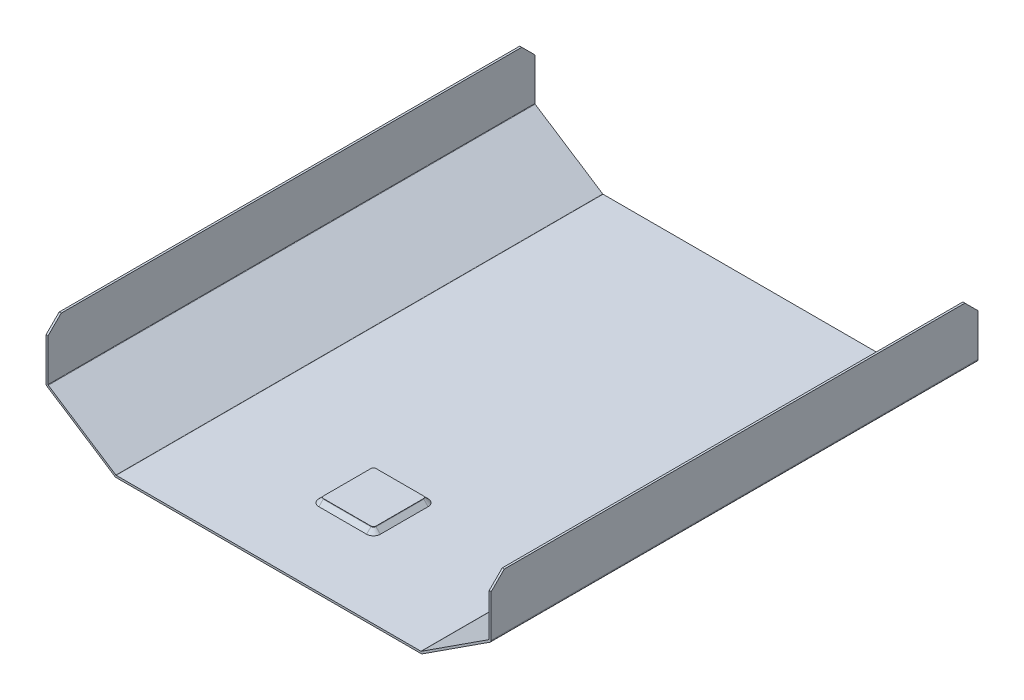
ISO-10303-21;
HEADER;
FILE_DESCRIPTION(('STEP AP214'),'2;1');
FILE_NAME('part.step','',(''),(''),'','','');
FILE_SCHEMA(('AUTOMOTIVE_DESIGN { 1 0 10303 214 1 1 1 1 }'));
ENDSEC;
DATA;
#1=APPLICATION_CONTEXT('core data for automotive mechanical design processes');
#2=APPLICATION_PROTOCOL_DEFINITION('international standard','automotive_design',2000,#1);
#3=PRODUCT_CONTEXT('',#1,'mechanical');
#4=PRODUCT('Part','Part','',(#3));
#5=PRODUCT_RELATED_PRODUCT_CATEGORY('part','',(#4));
#6=PRODUCT_DEFINITION_FORMATION('','',#4);
#7=PRODUCT_DEFINITION_CONTEXT('part definition',#1,'design');
#8=PRODUCT_DEFINITION('design','',#6,#7);
#9=PRODUCT_DEFINITION_SHAPE('','',#8);
#10=(LENGTH_UNIT() NAMED_UNIT(*) SI_UNIT(.MILLI.,.METRE.));
#11=(NAMED_UNIT(*) PLANE_ANGLE_UNIT() SI_UNIT($,.RADIAN.));
#12=(NAMED_UNIT(*) SI_UNIT($,.STERADIAN.) SOLID_ANGLE_UNIT());
#13=UNCERTAINTY_MEASURE_WITH_UNIT(LENGTH_MEASURE(1.E-05),#10,'distance_accuracy_value','');
#14=(GEOMETRIC_REPRESENTATION_CONTEXT(3) GLOBAL_UNCERTAINTY_ASSIGNED_CONTEXT((#13)) GLOBAL_UNIT_ASSIGNED_CONTEXT((#10,
#11,#12)) REPRESENTATION_CONTEXT('',''));
#15=CARTESIAN_POINT('',(0.,0.,0.));
#16=DIRECTION('',(0.,0.,1.));
#17=DIRECTION('',(1.,0.,0.));
#18=AXIS2_PLACEMENT_3D('',#15,#16,#17);
#19=CARTESIAN_POINT('',(0.,-54.26657104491,-62.));
#20=DIRECTION('',(0.,1.,0.));
#21=DIRECTION('',(1.,0.,0.));
#22=AXIS2_PLACEMENT_3D('',#19,#20,#21);
#23=PLANE('',#22);
#24=CARTESIAN_POINT('',(17.75,-54.26657104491,282.25));
#25=DIRECTION('',(0.,1.,0.));
#26=DIRECTION('',(0.,0.,1.));
#27=AXIS2_PLACEMENT_3D('',#24,#25,#26);
#28=CIRCLE('',#27,1.70740880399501);
#29=CARTESIAN_POINT('',(19.457408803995,-54.26657104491,282.25));
#30=VERTEX_POINT('',#29);
#31=CARTESIAN_POINT('',(17.74999999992,-54.26657104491,280.542591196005));
#32=VERTEX_POINT('',#31);
#33=EDGE_CURVE('E10',#30,#32,#28,.T.);
#34=ORIENTED_EDGE('',*,*,#33,.T.);
#35=DIRECTION('',(-1.,0.,0.));
#36=VECTOR('',#35,1.);
#37=CARTESIAN_POINT('',(17.74999999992,-54.26657104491,280.542591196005));
#38=LINE('',#37,#36);
#39=CARTESIAN_POINT('',(-17.74999999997,-54.26657104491,280.542591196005));
#40=VERTEX_POINT('',#39);
#41=EDGE_CURVE('E367',#32,#40,#38,.T.);
#42=ORIENTED_EDGE('',*,*,#41,.T.);
#43=CARTESIAN_POINT('',(-17.75,-54.26657104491,282.25));
#44=DIRECTION('',(0.,1.,0.));
#45=DIRECTION('',(0.,0.,1.));
#46=AXIS2_PLACEMENT_3D('',#43,#44,#45);
#47=CIRCLE('',#46,1.70740880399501);
#48=CARTESIAN_POINT('',(-19.457408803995,-54.26657104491,282.25));
#49=VERTEX_POINT('',#48);
#50=EDGE_CURVE('E525',#40,#49,#47,.T.);
#51=ORIENTED_EDGE('',*,*,#50,.T.);
#52=DIRECTION('',(0.,0.,1.));
#53=VECTOR('',#52,1.);
#54=CARTESIAN_POINT('',(-19.457408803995,-54.26657104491,282.25));
#55=LINE('',#54,#53);
#56=CARTESIAN_POINT('',(-19.457408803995,-54.26657104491,317.75));
#57=VERTEX_POINT('',#56);
#58=EDGE_CURVE('E647',#49,#57,#55,.T.);
#59=ORIENTED_EDGE('',*,*,#58,.T.);
#60=CARTESIAN_POINT('',(-17.75,-54.26657104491,317.75));
#61=DIRECTION('',(0.,1.,0.));
#62=DIRECTION('',(0.,0.,1.));
#63=AXIS2_PLACEMENT_3D('',#60,#61,#62);
#64=CIRCLE('',#63,1.70740880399);
#65=CARTESIAN_POINT('',(-17.7499999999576,-54.26657104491,319.45740880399));
#66=VERTEX_POINT('',#65);
#67=EDGE_CURVE('E599',#57,#66,#64,.T.);
#68=ORIENTED_EDGE('',*,*,#67,.T.);
#69=DIRECTION('',(1.,0.,1.4073249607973E-13));
#70=VECTOR('',#69,1.);
#71=CARTESIAN_POINT('',(-17.7499999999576,-54.26657104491,319.457408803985));
#72=LINE('',#71,#70);
#73=CARTESIAN_POINT('',(17.74999999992,-54.26657104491,319.45740880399));
#74=VERTEX_POINT('',#73);
#75=EDGE_CURVE('E796',#66,#74,#72,.T.);
#76=ORIENTED_EDGE('',*,*,#75,.T.);
#77=CARTESIAN_POINT('',(17.75,-54.26657104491,317.75));
#78=DIRECTION('',(0.,1.,0.));
#79=DIRECTION('',(0.,0.,1.));
#80=AXIS2_PLACEMENT_3D('',#77,#78,#79);
#81=CIRCLE('',#80,1.70740880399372);
#82=CARTESIAN_POINT('',(19.4574088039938,-54.26657104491,317.75));
#83=VERTEX_POINT('',#82);
#84=EDGE_CURVE('E795',#74,#83,#81,.T.);
#85=ORIENTED_EDGE('',*,*,#84,.T.);
#86=DIRECTION('',(0.,0.,-1.));
#87=VECTOR('',#86,1.);
#88=CARTESIAN_POINT('',(19.4574088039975,-54.26657104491,317.75));
#89=LINE('',#88,#87);
#90=EDGE_CURVE('E27',#83,#30,#89,.T.);
#91=ORIENTED_EDGE('',*,*,#90,.T.);
#92=EDGE_LOOP('',(#34,#42,#51,#59,#68,#76,#85,#91));
#93=FACE_BOUND('',#92,.T.);
#94=ADVANCED_FACE('F16',(#93),#23,.T.);
#95=CARTESIAN_POINT('',(17.75,-110.800433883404,282.25));
#96=DIRECTION('',(0.,1.,0.));
#97=DIRECTION('',(0.,0.,1.));
#98=AXIS2_PLACEMENT_3D('',#95,#96,#97);
#99=CYLINDRICAL_SURFACE('',#98,1.70740880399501);
#100=DIRECTION('',(0.,1.,0.));
#101=VECTOR('',#100,1.);
#102=CARTESIAN_POINT('',(19.457408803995,-110.800433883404,282.25));
#103=LINE('',#102,#101);
#104=CARTESIAN_POINT('',(19.457408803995,-54.4005456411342,282.25));
#105=VERTEX_POINT('',#104);
#106=EDGE_CURVE('E852',#105,#30,#103,.T.);
#107=ORIENTED_EDGE('',*,*,#106,.F.);
#108=CARTESIAN_POINT('',(17.75,-54.4005456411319,282.25));
#109=DIRECTION('',(0.,1.,0.));
#110=DIRECTION('',(0.,0.,-1.));
#111=AXIS2_PLACEMENT_3D('',#108,#109,#110);
#112=CIRCLE('',#111,1.70740880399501);
#113=CARTESIAN_POINT('',(17.75,-54.4005456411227,280.542591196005));
#114=VERTEX_POINT('',#113);
#115=EDGE_CURVE('E731',#105,#114,#112,.T.);
#116=ORIENTED_EDGE('',*,*,#115,.T.);
#117=DIRECTION('',(0.,1.,0.));
#118=VECTOR('',#117,1.);
#119=CARTESIAN_POINT('',(17.74999999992,-110.800433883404,280.542591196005));
#120=LINE('',#119,#118);
#121=EDGE_CURVE('E376',#114,#32,#120,.T.);
#122=ORIENTED_EDGE('',*,*,#121,.T.);
#123=ORIENTED_EDGE('',*,*,#33,.F.);
#124=EDGE_LOOP('',(#107,#116,#122,#123));
#125=FACE_BOUND('',#124,.T.);
#126=ADVANCED_FACE('F939',(#125),#99,.T.);
#127=CARTESIAN_POINT('',(19.4574088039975,-110.800433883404,317.75));
#128=DIRECTION('',(1.,0.,0.));
#129=DIRECTION('',(0.,0.,-1.));
#130=AXIS2_PLACEMENT_3D('',#127,#128,#129);
#131=PLANE('',#130);
#132=DIRECTION('',(0.,1.,0.));
#133=VECTOR('',#132,1.);
#134=CARTESIAN_POINT('',(19.4574088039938,-110.800433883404,317.75));
#135=LINE('',#134,#133);
#136=CARTESIAN_POINT('',(19.4574088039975,-54.4005456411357,317.75));
#137=VERTEX_POINT('',#136);
#138=EDGE_CURVE('E791',#137,#83,#135,.T.);
#139=ORIENTED_EDGE('',*,*,#138,.F.);
#140=DIRECTION('',(0.,0.,-1.));
#141=VECTOR('',#140,1.);
#142=CARTESIAN_POINT('',(19.4574088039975,-54.4005456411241,318.3152445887));
#143=LINE('',#142,#141);
#144=EDGE_CURVE('E456',#137,#105,#143,.T.);
#145=ORIENTED_EDGE('',*,*,#144,.T.);
#146=ORIENTED_EDGE('',*,*,#106,.T.);
#147=ORIENTED_EDGE('',*,*,#90,.F.);
#148=EDGE_LOOP('',(#139,#145,#146,#147));
#149=FACE_BOUND('',#148,.T.);
#150=ADVANCED_FACE('F946',(#149),#131,.T.);
#151=CARTESIAN_POINT('',(17.75,-110.800433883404,317.75));
#152=DIRECTION('',(0.,1.,0.));
#153=DIRECTION('',(0.,0.,1.));
#154=AXIS2_PLACEMENT_3D('',#151,#152,#153);
#155=CYLINDRICAL_SURFACE('',#154,1.70740880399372);
#156=DIRECTION('',(0.,1.,0.));
#157=VECTOR('',#156,1.);
#158=CARTESIAN_POINT('',(17.74999999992,-110.800433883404,319.45740880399));
#159=LINE('',#158,#157);
#160=CARTESIAN_POINT('',(17.75,-54.4005456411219,319.457408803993));
#161=VERTEX_POINT('',#160);
#162=EDGE_CURVE('E603',#161,#74,#159,.T.);
#163=ORIENTED_EDGE('',*,*,#162,.F.);
#164=CARTESIAN_POINT('',(17.75,-54.4005456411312,317.75));
#165=DIRECTION('',(0.,1.,0.));
#166=DIRECTION('',(0.,0.,-1.));
#167=AXIS2_PLACEMENT_3D('',#164,#165,#166);
#168=CIRCLE('',#167,1.70740880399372);
#169=EDGE_CURVE('E455',#161,#137,#168,.T.);
#170=ORIENTED_EDGE('',*,*,#169,.T.);
#171=ORIENTED_EDGE('',*,*,#138,.T.);
#172=ORIENTED_EDGE('',*,*,#84,.F.);
#173=EDGE_LOOP('',(#163,#170,#171,#172));
#174=FACE_BOUND('',#173,.T.);
#175=ADVANCED_FACE('F1578',(#174),#155,.T.);
#176=CARTESIAN_POINT('',(-17.7499999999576,-110.800433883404,319.457408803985));
#177=DIRECTION('',(-1.4073249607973E-13,0.,1.));
#178=DIRECTION('',(1.,0.,1.4073249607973E-13));
#179=AXIS2_PLACEMENT_3D('',#176,#177,#178);
#180=PLANE('',#179);
#181=DIRECTION('',(0.,1.,0.));
#182=VECTOR('',#181,1.);
#183=CARTESIAN_POINT('',(-17.7499999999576,-110.800433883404,319.45740880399));
#184=LINE('',#183,#182);
#185=CARTESIAN_POINT('',(-17.75,-54.4005456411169,319.457408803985));
#186=VERTEX_POINT('',#185);
#187=EDGE_CURVE('E604',#186,#66,#184,.T.);
#188=ORIENTED_EDGE('',*,*,#187,.F.);
#189=DIRECTION('',(1.,0.,0.));
#190=VECTOR('',#189,1.);
#191=CARTESIAN_POINT('',(207.9242000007,-54.4005456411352,319.457408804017));
#192=LINE('',#191,#190);
#193=EDGE_CURVE('E495',#186,#161,#192,.T.);
#194=ORIENTED_EDGE('',*,*,#193,.T.);
#195=ORIENTED_EDGE('',*,*,#162,.T.);
#196=ORIENTED_EDGE('',*,*,#75,.F.);
#197=EDGE_LOOP('',(#188,#194,#195,#196));
#198=FACE_BOUND('',#197,.T.);
#199=ADVANCED_FACE('F1449',(#198),#180,.T.);
#200=CARTESIAN_POINT('',(-17.75,-110.800433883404,317.75));
#201=DIRECTION('',(0.,1.,0.));
#202=DIRECTION('',(0.,0.,1.));
#203=AXIS2_PLACEMENT_3D('',#200,#201,#202);
#204=CYLINDRICAL_SURFACE('',#203,1.70740880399);
#205=DIRECTION('',(0.,1.,0.));
#206=VECTOR('',#205,1.);
#207=CARTESIAN_POINT('',(-19.457408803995,-110.800433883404,317.75));
#208=LINE('',#207,#206);
#209=CARTESIAN_POINT('',(-19.45740880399,-54.4005456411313,317.75));
#210=VERTEX_POINT('',#209);
#211=EDGE_CURVE('E350',#210,#57,#208,.T.);
#212=ORIENTED_EDGE('',*,*,#211,.F.);
#213=CARTESIAN_POINT('',(-17.75,-54.400545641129,317.75));
#214=DIRECTION('',(0.,1.,0.));
#215=DIRECTION('',(0.,0.,-1.));
#216=AXIS2_PLACEMENT_3D('',#213,#214,#215);
#217=CIRCLE('',#216,1.70740880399);
#218=EDGE_CURVE('E673',#210,#186,#217,.T.);
#219=ORIENTED_EDGE('',*,*,#218,.T.);
#220=ORIENTED_EDGE('',*,*,#187,.T.);
#221=ORIENTED_EDGE('',*,*,#67,.F.);
#222=EDGE_LOOP('',(#212,#219,#220,#221));
#223=FACE_BOUND('',#222,.T.);
#224=ADVANCED_FACE('F1444',(#223),#204,.T.);
#225=CARTESIAN_POINT('',(-19.457408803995,-110.800433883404,282.25));
#226=DIRECTION('',(-1.,0.,0.));
#227=DIRECTION('',(0.,0.,1.));
#228=AXIS2_PLACEMENT_3D('',#225,#226,#227);
#229=PLANE('',#228);
#230=DIRECTION('',(0.,1.,0.));
#231=VECTOR('',#230,1.);
#232=CARTESIAN_POINT('',(-19.457408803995,-110.800433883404,282.25));
#233=LINE('',#232,#231);
#234=CARTESIAN_POINT('',(-19.457408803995,-54.4005456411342,282.25));
#235=VERTEX_POINT('',#234);
#236=EDGE_CURVE('E371',#235,#49,#233,.T.);
#237=ORIENTED_EDGE('',*,*,#236,.F.);
#238=DIRECTION('',(0.,0.,1.));
#239=VECTOR('',#238,1.);
#240=CARTESIAN_POINT('',(-19.457408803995,-54.4005456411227,318.3152445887));
#241=LINE('',#240,#239);
#242=EDGE_CURVE('E672',#235,#210,#241,.T.);
#243=ORIENTED_EDGE('',*,*,#242,.T.);
#244=ORIENTED_EDGE('',*,*,#211,.T.);
#245=ORIENTED_EDGE('',*,*,#58,.F.);
#246=EDGE_LOOP('',(#237,#243,#244,#245));
#247=FACE_BOUND('',#246,.T.);
#248=ADVANCED_FACE('F1448',(#247),#229,.T.);
#249=CARTESIAN_POINT('',(-17.75,-110.800433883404,282.25));
#250=DIRECTION('',(0.,1.,0.));
#251=DIRECTION('',(0.,0.,1.));
#252=AXIS2_PLACEMENT_3D('',#249,#250,#251);
#253=CYLINDRICAL_SURFACE('',#252,1.70740880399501);
#254=DIRECTION('',(0.,1.,0.));
#255=VECTOR('',#254,1.);
#256=CARTESIAN_POINT('',(-17.74999999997,-110.800433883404,280.542591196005));
#257=LINE('',#256,#255);
#258=CARTESIAN_POINT('',(-17.74999999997,-54.4005456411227,280.542591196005));
#259=VERTEX_POINT('',#258);
#260=EDGE_CURVE('E372',#259,#40,#257,.T.);
#261=ORIENTED_EDGE('',*,*,#260,.F.);
#262=CARTESIAN_POINT('',(-17.75,-54.4005456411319,282.25));
#263=DIRECTION('',(0.,1.,0.));
#264=DIRECTION('',(0.,0.,-1.));
#265=AXIS2_PLACEMENT_3D('',#262,#263,#264);
#266=CIRCLE('',#265,1.70740880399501);
#267=EDGE_CURVE('E900',#259,#235,#266,.T.);
#268=ORIENTED_EDGE('',*,*,#267,.T.);
#269=ORIENTED_EDGE('',*,*,#236,.T.);
#270=ORIENTED_EDGE('',*,*,#50,.F.);
#271=EDGE_LOOP('',(#261,#268,#269,#270));
#272=FACE_BOUND('',#271,.T.);
#273=ADVANCED_FACE('F1437',(#272),#253,.T.);
#274=CARTESIAN_POINT('',(17.74999999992,-110.800433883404,280.542591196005));
#275=DIRECTION('',(0.,0.,-1.));
#276=DIRECTION('',(0.,-1.,0.));
#277=AXIS2_PLACEMENT_3D('',#274,#275,#276);
#278=PLANE('',#277);
#279=ORIENTED_EDGE('',*,*,#121,.F.);
#280=DIRECTION('',(-1.,0.,0.));
#281=VECTOR('',#280,1.);
#282=CARTESIAN_POINT('',(-18.31524458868,-54.4005456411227,280.542591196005));
#283=LINE('',#282,#281);
#284=EDGE_CURVE('E450',#114,#259,#283,.T.);
#285=ORIENTED_EDGE('',*,*,#284,.T.);
#286=ORIENTED_EDGE('',*,*,#260,.T.);
#287=ORIENTED_EDGE('',*,*,#41,.F.);
#288=EDGE_LOOP('',(#279,#285,#286,#287));
#289=FACE_BOUND('',#288,.T.);
#290=ADVANCED_FACE('F1433',(#289),#278,.T.);
#291=CARTESIAN_POINT('',(-113.4075730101,-57.76657104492,15.));
#292=DIRECTION('',(0.,-1.,0.));
#293=DIRECTION('',(0.,0.,-1.));
#294=AXIS2_PLACEMENT_3D('',#291,#292,#293);
#295=PLANE('',#294);
#296=CARTESIAN_POINT('',(17.75,-57.76657104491,282.25));
#297=DIRECTION('',(0.,1.,0.));
#298=DIRECTION('',(1.,0.,3.69595827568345E-12));
#299=AXIS2_PLACEMENT_3D('',#296,#297,#298);
#300=CIRCLE('',#299,5.121622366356);
#301=CARTESIAN_POINT('',(22.87162236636,-57.76657104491,282.25));
#302=VERTEX_POINT('',#301);
#303=CARTESIAN_POINT('',(17.75000000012,-57.7665710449,277.1283776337));
#304=VERTEX_POINT('',#303);
#305=EDGE_CURVE('E679',#302,#304,#300,.T.);
#306=ORIENTED_EDGE('',*,*,#305,.F.);
#307=DIRECTION('',(0.,0.,1.));
#308=VECTOR('',#307,1.);
#309=CARTESIAN_POINT('',(22.87162236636,-57.76657104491,282.25));
#310=LINE('',#309,#308);
#311=CARTESIAN_POINT('',(22.87162236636,-57.76657104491,317.75));
#312=VERTEX_POINT('',#311);
#313=EDGE_CURVE('E1057',#302,#312,#310,.T.);
#314=ORIENTED_EDGE('',*,*,#313,.T.);
#315=CARTESIAN_POINT('',(17.75,-57.76657104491,317.75));
#316=DIRECTION('',(0.,1.,0.));
#317=DIRECTION('',(6.99745971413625E-11,0.,1.));
#318=AXIS2_PLACEMENT_3D('',#315,#316,#317);
#319=CIRCLE('',#318,5.12162236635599);
#320=CARTESIAN_POINT('',(17.75000000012,-57.7665710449,322.8716223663));
#321=VERTEX_POINT('',#320);
#322=EDGE_CURVE('E753',#321,#312,#319,.T.);
#323=ORIENTED_EDGE('',*,*,#322,.F.);
#324=DIRECTION('',(-1.,0.,0.));
#325=VECTOR('',#324,1.);
#326=CARTESIAN_POINT('',(17.75000000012,-57.7665710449,322.8716223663));
#327=LINE('',#326,#325);
#328=CARTESIAN_POINT('',(-17.75000000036,-57.76657104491,322.8716223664));
#329=VERTEX_POINT('',#328);
#330=EDGE_CURVE('E496',#321,#329,#327,.T.);
#331=ORIENTED_EDGE('',*,*,#330,.T.);
#332=CARTESIAN_POINT('',(-17.75,-57.76657104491,317.75));
#333=DIRECTION('',(0.,1.,0.));
#334=DIRECTION('',(-1.,0.,-3.68511968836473E-12));
#335=AXIS2_PLACEMENT_3D('',#332,#333,#334);
#336=CIRCLE('',#335,5.121622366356);
#337=CARTESIAN_POINT('',(-22.87162236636,-57.76657104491,317.75));
#338=VERTEX_POINT('',#337);
#339=EDGE_CURVE('E434',#338,#329,#336,.T.);
#340=ORIENTED_EDGE('',*,*,#339,.F.);
#341=DIRECTION('',(0.,0.,1.));
#342=VECTOR('',#341,1.);
#343=CARTESIAN_POINT('',(-22.87162236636,-57.76657104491,282.25));
#344=LINE('',#343,#342);
#345=CARTESIAN_POINT('',(-22.87162236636,-57.76657104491,282.25));
#346=VERTEX_POINT('',#345);
#347=EDGE_CURVE('E745',#346,#338,#344,.T.);
#348=ORIENTED_EDGE('',*,*,#347,.F.);
#349=CARTESIAN_POINT('',(-17.75,-57.76657104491,282.25));
#350=DIRECTION('',(0.,1.,0.));
#351=DIRECTION('',(-6.99745971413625E-11,0.,-1.));
#352=AXIS2_PLACEMENT_3D('',#349,#350,#351);
#353=CIRCLE('',#352,5.12162236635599);
#354=CARTESIAN_POINT('',(-17.75000000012,-57.7665710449,277.1283776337));
#355=VERTEX_POINT('',#354);
#356=EDGE_CURVE('E469',#355,#346,#353,.T.);
#357=ORIENTED_EDGE('',*,*,#356,.F.);
#358=DIRECTION('',(1.,0.,0.));
#359=VECTOR('',#358,1.);
#360=CARTESIAN_POINT('',(-17.75000000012,-57.7665710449,277.1283776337));
#361=LINE('',#360,#359);
#362=EDGE_CURVE('E683',#355,#304,#361,.T.);
#363=ORIENTED_EDGE('',*,*,#362,.T.);
#364=EDGE_LOOP('',(#306,#314,#323,#331,#340,#348,#357,#363));
#365=FACE_BOUND('',#364,.T.);
#366=DIRECTION('',(-2.13951002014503E-06,0.,0.999999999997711));
#367=VECTOR('',#366,1.);
#368=CARTESIAN_POINT('',(-113.2594662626,-57.76657104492,16.));
#369=LINE('',#368,#367);
#370=CARTESIAN_POINT('',(-113.2594662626,-57.76657104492,16.));
#371=VERTEX_POINT('',#370);
#372=CARTESIAN_POINT('',(-113.2602407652,-57.76657104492,378.));
#373=VERTEX_POINT('',#372);
#374=EDGE_CURVE('E507',#371,#373,#369,.T.);
#375=ORIENTED_EDGE('',*,*,#374,.T.);
#376=DIRECTION('',(-1.,0.,0.));
#377=VECTOR('',#376,1.);
#378=CARTESIAN_POINT('',(113.2602407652,-57.76657104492,378.));
#379=LINE('',#378,#377);
#380=CARTESIAN_POINT('',(113.2602407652,-57.76657104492,378.));
#381=VERTEX_POINT('',#380);
#382=EDGE_CURVE('E524',#381,#373,#379,.T.);
#383=ORIENTED_EDGE('',*,*,#382,.F.);
#384=DIRECTION('',(-2.13951002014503E-06,0.,-0.999999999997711));
#385=VECTOR('',#384,1.);
#386=CARTESIAN_POINT('',(113.2602407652,-57.76657104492,378.));
#387=LINE('',#386,#385);
#388=CARTESIAN_POINT('',(113.2594662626,-57.76657104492,16.));
#389=VERTEX_POINT('',#388);
#390=EDGE_CURVE('E426',#381,#389,#387,.T.);
#391=ORIENTED_EDGE('',*,*,#390,.T.);
#392=DIRECTION('',(1.,0.,0.));
#393=VECTOR('',#392,1.);
#394=CARTESIAN_POINT('',(-113.2594662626,-57.76657104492,16.));
#395=LINE('',#394,#393);
#396=EDGE_CURVE('E537',#371,#389,#395,.T.);
#397=ORIENTED_EDGE('',*,*,#396,.F.);
#398=EDGE_LOOP('',(#375,#383,#391,#397));
#399=FACE_BOUND('',#398,.T.);
#400=ADVANCED_FACE('F985',(#365,#399),#295,.F.);
#401=CARTESIAN_POINT('',(-56.62973313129,-58.51657104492,16.));
#402=DIRECTION('',(0.,0.,1.));
#403=DIRECTION('',(1.,0.,0.));
#404=AXIS2_PLACEMENT_3D('',#401,#402,#403);
#405=PLANE('',#404);
#406=CARTESIAN_POINT('',(-113.2594662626,-57.26657104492,16.));
#407=DIRECTION('',(0.,0.,1.));
#408=DIRECTION('',(-0.544639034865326,-0.838670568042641,0.));
#409=AXIS2_PLACEMENT_3D('',#406,#407,#408);
#410=CIRCLE('',#409,2.);
#411=CARTESIAN_POINT('',(-114.3487443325,-58.94391218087,16.));
#412=VERTEX_POINT('',#411);
#413=CARTESIAN_POINT('',(-113.2594662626,-59.26657104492,16.));
#414=VERTEX_POINT('',#413);
#415=EDGE_CURVE('E478',#412,#414,#410,.T.);
#416=ORIENTED_EDGE('',*,*,#415,.F.);
#417=DIRECTION('',(0.838670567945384,-0.544639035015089,0.));
#418=VECTOR('',#417,1.);
#419=CARTESIAN_POINT('',(-164.5892780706,-26.31732808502,16.));
#420=LINE('',#419,#418);
#421=CARTESIAN_POINT('',(-164.5892780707,-26.31732808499,16.));
#422=VERTEX_POINT('',#421);
#423=EDGE_CURVE('E416',#422,#412,#420,.T.);
#424=ORIENTED_EDGE('',*,*,#423,.F.);
#425=CARTESIAN_POINT('',(-163.5000000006,-24.63998694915,16.));
#426=DIRECTION('',(0.,0.,1.));
#427=DIRECTION('',(-1.,0.,0.));
#428=AXIS2_PLACEMENT_3D('',#425,#426,#427);
#429=CIRCLE('',#428,2.);
#430=CARTESIAN_POINT('',(-165.5000000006,-24.63998694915,16.));
#431=VERTEX_POINT('',#430);
#432=EDGE_CURVE('E639',#431,#422,#429,.T.);
#433=ORIENTED_EDGE('',*,*,#432,.F.);
#434=DIRECTION('',(0.,1.,0.));
#435=VECTOR('',#434,1.);
#436=CARTESIAN_POINT('',(-165.5000000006,-24.63998694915,16.));
#437=LINE('',#436,#435);
#438=CARTESIAN_POINT('',(-165.5000000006,6.642895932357,16.));
#439=VERTEX_POINT('',#438);
#440=EDGE_CURVE('E591',#431,#439,#437,.T.);
#441=ORIENTED_EDGE('',*,*,#440,.T.);
#442=DIRECTION('',(-1.,0.,0.));
#443=VECTOR('',#442,1.);
#444=CARTESIAN_POINT('',(-164.0000000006,6.642895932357,16.));
#445=LINE('',#444,#443);
#446=CARTESIAN_POINT('',(-164.0000000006,6.642895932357,16.));
#447=VERTEX_POINT('',#446);
#448=EDGE_CURVE('E571',#447,#439,#445,.T.);
#449=ORIENTED_EDGE('',*,*,#448,.F.);
#450=DIRECTION('',(0.,1.,0.));
#451=VECTOR('',#450,1.);
#452=CARTESIAN_POINT('',(-164.0000000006,-24.63998694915,16.));
#453=LINE('',#452,#451);
#454=CARTESIAN_POINT('',(-164.0000000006,-24.63998694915,16.));
#455=VERTEX_POINT('',#454);
#456=EDGE_CURVE('E397',#455,#447,#453,.T.);
#457=ORIENTED_EDGE('',*,*,#456,.F.);
#458=CARTESIAN_POINT('',(-163.5000000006,-24.63998694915,16.));
#459=DIRECTION('',(0.,0.,-1.));
#460=DIRECTION('',(-0.544639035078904,-0.838670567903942,0.));
#461=AXIS2_PLACEMENT_3D('',#458,#459,#460);
#462=CIRCLE('',#461,0.499999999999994);
#463=CARTESIAN_POINT('',(-163.7723195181,-25.05932223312,16.));
#464=VERTEX_POINT('',#463);
#465=EDGE_CURVE('E430',#464,#455,#462,.T.);
#466=ORIENTED_EDGE('',*,*,#465,.F.);
#467=DIRECTION('',(-0.838670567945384,0.544639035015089,0.));
#468=VECTOR('',#467,1.);
#469=CARTESIAN_POINT('',(-113.5311362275,-57.68632815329,16.));
#470=LINE('',#469,#468);
#471=CARTESIAN_POINT('',(-113.5311362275,-57.68632815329,16.));
#472=VERTEX_POINT('',#471);
#473=EDGE_CURVE('E387',#472,#464,#470,.T.);
#474=ORIENTED_EDGE('',*,*,#473,.F.);
#475=CARTESIAN_POINT('',(-113.2594662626,-57.26657104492,16.));
#476=DIRECTION('',(0.,0.,-1.));
#477=DIRECTION('',(-1.,0.,0.));
#478=AXIS2_PLACEMENT_3D('',#475,#476,#477);
#479=CIRCLE('',#478,0.5);
#480=EDGE_CURVE('E687',#371,#472,#479,.T.);
#481=ORIENTED_EDGE('',*,*,#480,.F.);
#482=ORIENTED_EDGE('',*,*,#396,.T.);
#483=CARTESIAN_POINT('',(113.2594662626,-57.26657104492,16.));
#484=DIRECTION('',(0.,0.,-1.));
#485=DIRECTION('',(1.,0.,0.));
#486=AXIS2_PLACEMENT_3D('',#483,#484,#485);
#487=CIRCLE('',#486,0.5);
#488=CARTESIAN_POINT('',(113.5311362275,-57.68632815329,16.));
#489=VERTEX_POINT('',#488);
#490=EDGE_CURVE('E460',#489,#389,#487,.T.);
#491=ORIENTED_EDGE('',*,*,#490,.F.);
#492=DIRECTION('',(-0.838670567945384,-0.544639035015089,0.));
#493=VECTOR('',#492,1.);
#494=CARTESIAN_POINT('',(163.7723195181,-25.05932223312,16.));
#495=LINE('',#494,#493);
#496=CARTESIAN_POINT('',(163.7723195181,-25.05932223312,16.));
#497=VERTEX_POINT('',#496);
#498=EDGE_CURVE('E358',#497,#489,#495,.T.);
#499=ORIENTED_EDGE('',*,*,#498,.F.);
#500=CARTESIAN_POINT('',(163.5000000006,-24.63998694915,16.));
#501=DIRECTION('',(0.,0.,-1.));
#502=DIRECTION('',(1.,0.,0.));
#503=AXIS2_PLACEMENT_3D('',#500,#501,#502);
#504=CIRCLE('',#503,0.5);
#505=CARTESIAN_POINT('',(164.0000000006,-24.63998694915,16.));
#506=VERTEX_POINT('',#505);
#507=EDGE_CURVE('E580',#506,#497,#504,.T.);
#508=ORIENTED_EDGE('',*,*,#507,.F.);
#509=DIRECTION('',(0.,1.,0.));
#510=VECTOR('',#509,1.);
#511=CARTESIAN_POINT('',(164.0000000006,-24.63998694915,16.));
#512=LINE('',#511,#510);
#513=CARTESIAN_POINT('',(164.0000000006,6.642895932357,16.));
#514=VERTEX_POINT('',#513);
#515=EDGE_CURVE('E804',#506,#514,#512,.T.);
#516=ORIENTED_EDGE('',*,*,#515,.T.);
#517=DIRECTION('',(1.,0.,0.));
#518=VECTOR('',#517,1.);
#519=CARTESIAN_POINT('',(164.0000000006,6.642895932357,16.));
#520=LINE('',#519,#518);
#521=CARTESIAN_POINT('',(165.5000000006,6.642895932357,16.));
#522=VERTEX_POINT('',#521);
#523=EDGE_CURVE('E521',#514,#522,#520,.T.);
#524=ORIENTED_EDGE('',*,*,#523,.T.);
#525=DIRECTION('',(0.,1.,0.));
#526=VECTOR('',#525,1.);
#527=CARTESIAN_POINT('',(165.5000000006,-24.63998694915,16.));
#528=LINE('',#527,#526);
#529=CARTESIAN_POINT('',(165.5000000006,-24.63998694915,16.));
#530=VERTEX_POINT('',#529);
#531=EDGE_CURVE('E508',#530,#522,#528,.T.);
#532=ORIENTED_EDGE('',*,*,#531,.F.);
#533=CARTESIAN_POINT('',(163.5000000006,-24.63998694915,16.));
#534=DIRECTION('',(0.,0.,1.));
#535=DIRECTION('',(0.544639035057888,-0.83867056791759,0.));
#536=AXIS2_PLACEMENT_3D('',#533,#534,#535);
#537=CIRCLE('',#536,2.);
#538=CARTESIAN_POINT('',(164.5892780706,-26.31732808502,16.));
#539=VERTEX_POINT('',#538);
#540=EDGE_CURVE('E409',#539,#530,#537,.T.);
#541=ORIENTED_EDGE('',*,*,#540,.F.);
#542=DIRECTION('',(0.838670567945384,0.544639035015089,0.));
#543=VECTOR('',#542,1.);
#544=CARTESIAN_POINT('',(114.3487443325,-58.94391218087,16.));
#545=LINE('',#544,#543);
#546=CARTESIAN_POINT('',(114.3487443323,-58.94391218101,16.));
#547=VERTEX_POINT('',#546);
#548=EDGE_CURVE('E611',#547,#539,#545,.T.);
#549=ORIENTED_EDGE('',*,*,#548,.F.);
#550=CARTESIAN_POINT('',(113.2594662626,-57.26657104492,16.));
#551=DIRECTION('',(0.,0.,1.));
#552=DIRECTION('',(0.,-1.,0.));
#553=AXIS2_PLACEMENT_3D('',#550,#551,#552);
#554=CIRCLE('',#553,2.);
#555=CARTESIAN_POINT('',(113.2594662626,-59.26657104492,16.));
#556=VERTEX_POINT('',#555);
#557=EDGE_CURVE('E381',#556,#547,#554,.T.);
#558=ORIENTED_EDGE('',*,*,#557,.F.);
#559=DIRECTION('',(-1.,0.,0.));
#560=VECTOR('',#559,1.);
#561=CARTESIAN_POINT('',(113.2594662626,-59.26657104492,16.));
#562=LINE('',#561,#560);
#563=EDGE_CURVE('E533',#556,#414,#562,.T.);
#564=ORIENTED_EDGE('',*,*,#563,.T.);
#565=EDGE_LOOP('',(#416,#424,#433,#441,#449,#457,#466,#474,#481,#482,#491,#499,#508,#516,#524,
#532,#541,#549,#558,#564));
#566=FACE_BOUND('',#565,.T.);
#567=ADVANCED_FACE('F982',(#566),#405,.F.);
#568=CARTESIAN_POINT('',(-113.4075730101,-59.26657104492,15.));
#569=DIRECTION('',(0.,-1.,0.));
#570=DIRECTION('',(0.,0.,-1.));
#571=AXIS2_PLACEMENT_3D('',#568,#569,#570);
#572=PLANE('',#571);
#573=CARTESIAN_POINT('',(17.75,-59.26657104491,317.75));
#574=DIRECTION('',(0.,-1.,0.));
#575=DIRECTION('',(1.,0.,9.39038543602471E-10));
#576=AXIS2_PLACEMENT_3D('',#573,#574,#575);
#577=CIRCLE('',#576,4.914515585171);
#578=CARTESIAN_POINT('',(22.66451558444,-59.26657104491,317.75));
#579=VERTEX_POINT('',#578);
#580=CARTESIAN_POINT('',(17.75,-59.26657104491,322.6645155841));
#581=VERTEX_POINT('',#580);
#582=EDGE_CURVE('E501',#579,#581,#577,.T.);
#583=ORIENTED_EDGE('',*,*,#582,.F.);
#584=DIRECTION('',(0.,0.,-1.));
#585=VECTOR('',#584,1.);
#586=CARTESIAN_POINT('',(22.66451558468,-59.26657104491,317.7500000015));
#587=LINE('',#586,#585);
#588=CARTESIAN_POINT('',(22.66451558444,-59.26657104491,282.25));
#589=VERTEX_POINT('',#588);
#590=EDGE_CURVE('E502',#579,#589,#587,.T.);
#591=ORIENTED_EDGE('',*,*,#590,.T.);
#592=CARTESIAN_POINT('',(17.75,-59.26657104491,282.25));
#593=DIRECTION('',(0.,-1.,0.));
#594=DIRECTION('',(9.87076235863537E-10,0.,-1.));
#595=AXIS2_PLACEMENT_3D('',#592,#593,#594);
#596=CIRCLE('',#595,4.91451558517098);
#597=CARTESIAN_POINT('',(17.75000000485,-59.26657104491,277.3354844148));
#598=VERTEX_POINT('',#597);
#599=EDGE_CURVE('E532',#598,#589,#596,.T.);
#600=ORIENTED_EDGE('',*,*,#599,.F.);
#601=DIRECTION('',(-1.,0.,0.));
#602=VECTOR('',#601,1.);
#603=CARTESIAN_POINT('',(17.75000000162,-59.26657104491,277.3354844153));
#604=LINE('',#603,#602);
#605=CARTESIAN_POINT('',(-17.75,-59.26657104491,277.3354844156));
#606=VERTEX_POINT('',#605);
#607=EDGE_CURVE('E763',#598,#606,#604,.T.);
#608=ORIENTED_EDGE('',*,*,#607,.T.);
#609=CARTESIAN_POINT('',(-17.75,-59.26657104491,282.25));
#610=DIRECTION('',(0.,-1.,0.));
#611=DIRECTION('',(-1.,0.,-1.06109604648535E-09));
#612=AXIS2_PLACEMENT_3D('',#609,#610,#611);
#613=CIRCLE('',#612,4.914515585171);
#614=CARTESIAN_POINT('',(-22.66451558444,-59.26657104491,282.25));
#615=VERTEX_POINT('',#614);
#616=EDGE_CURVE('E777',#615,#606,#613,.T.);
#617=ORIENTED_EDGE('',*,*,#616,.F.);
#618=DIRECTION('',(0.,0.,1.));
#619=VECTOR('',#618,1.);
#620=CARTESIAN_POINT('',(-22.66451558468,-59.26657104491,282.2499999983));
#621=LINE('',#620,#619);
#622=CARTESIAN_POINT('',(-22.66451558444,-59.26657104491,317.75));
#623=VERTEX_POINT('',#622);
#624=EDGE_CURVE('E610',#615,#623,#621,.T.);
#625=ORIENTED_EDGE('',*,*,#624,.T.);
#626=CARTESIAN_POINT('',(-17.75,-59.26657104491,317.75));
#627=DIRECTION('',(0.,-1.,0.));
#628=DIRECTION('',(-1.37119210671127E-09,0.,1.));
#629=AXIS2_PLACEMENT_3D('',#626,#627,#628);
#630=CIRCLE('',#629,4.91451558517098);
#631=CARTESIAN_POINT('',(-17.75,-59.26657104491,322.6645155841));
#632=VERTEX_POINT('',#631);
#633=EDGE_CURVE('E800',#632,#623,#630,.T.);
#634=ORIENTED_EDGE('',*,*,#633,.F.);
#635=DIRECTION('',(1.,0.,0.));
#636=VECTOR('',#635,1.);
#637=CARTESIAN_POINT('',(-17.75000000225,-59.26657104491,322.6645155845));
#638=LINE('',#637,#636);
#639=EDGE_CURVE('E340',#632,#581,#638,.T.);
#640=ORIENTED_EDGE('',*,*,#639,.T.);
#641=EDGE_LOOP('',(#583,#591,#600,#608,#617,#625,#634,#640));
#642=FACE_BOUND('',#641,.T.);
#643=DIRECTION('',(0.,0.,-1.));
#644=VECTOR('',#643,1.);
#645=CARTESIAN_POINT('',(-113.2594662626,-59.26657104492,378.));
#646=LINE('',#645,#644);
#647=CARTESIAN_POINT('',(-113.2594662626,-59.26657104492,378.));
#648=VERTEX_POINT('',#647);
#649=EDGE_CURVE('E595',#648,#414,#646,.T.);
#650=ORIENTED_EDGE('',*,*,#649,.T.);
#651=ORIENTED_EDGE('',*,*,#563,.F.);
#652=DIRECTION('',(0.,0.,1.));
#653=VECTOR('',#652,1.);
#654=CARTESIAN_POINT('',(113.2594662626,-59.26657104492,16.));
#655=LINE('',#654,#653);
#656=CARTESIAN_POINT('',(113.2594662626,-59.26657104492,378.));
#657=VERTEX_POINT('',#656);
#658=EDGE_CURVE('E377',#556,#657,#655,.T.);
#659=ORIENTED_EDGE('',*,*,#658,.T.);
#660=DIRECTION('',(1.,0.,0.));
#661=VECTOR('',#660,1.);
#662=CARTESIAN_POINT('',(-113.2594662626,-59.26657104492,378.));
#663=LINE('',#662,#661);
#664=EDGE_CURVE('E425',#648,#657,#663,.T.);
#665=ORIENTED_EDGE('',*,*,#664,.F.);
#666=EDGE_LOOP('',(#650,#651,#659,#665));
#667=FACE_BOUND('',#666,.T.);
#668=ADVANCED_FACE('F916',(#642,#667),#572,.T.);
#669=CARTESIAN_POINT('',(-56.62973313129,-58.51657104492,378.));
#670=DIRECTION('',(0.,0.,1.));
#671=DIRECTION('',(1.,0.,0.));
#672=AXIS2_PLACEMENT_3D('',#669,#670,#671);
#673=PLANE('',#672);
#674=CARTESIAN_POINT('',(-113.2594662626,-57.26657104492,378.));
#675=DIRECTION('',(0.,0.,1.));
#676=DIRECTION('',(-1.,0.,0.));
#677=AXIS2_PLACEMENT_3D('',#674,#675,#676);
#678=CIRCLE('',#677,0.5);
#679=CARTESIAN_POINT('',(-113.53178578,-57.68590632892,378.));
#680=VERTEX_POINT('',#679);
#681=EDGE_CURVE('E503',#680,#373,#678,.T.);
#682=ORIENTED_EDGE('',*,*,#681,.F.);
#683=DIRECTION('',(0.838670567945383,-0.54463903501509,0.));
#684=VECTOR('',#683,1.);
#685=CARTESIAN_POINT('',(-163.7723195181,-25.05932223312,378.));
#686=LINE('',#685,#684);
#687=CARTESIAN_POINT('',(-163.7723195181,-25.0593222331,378.));
#688=VERTEX_POINT('',#687);
#689=EDGE_CURVE('E572',#688,#680,#686,.T.);
#690=ORIENTED_EDGE('',*,*,#689,.F.);
#691=CARTESIAN_POINT('',(-163.5000000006,-24.63998694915,378.));
#692=DIRECTION('',(0.,0.,1.));
#693=DIRECTION('',(-1.,-3.40005801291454E-13,0.));
#694=AXIS2_PLACEMENT_3D('',#691,#692,#693);
#695=CIRCLE('',#694,0.5);
#696=CARTESIAN_POINT('',(-164.0000000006,-24.63998694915,378.));
#697=VERTEX_POINT('',#696);
#698=EDGE_CURVE('E576',#697,#688,#695,.T.);
#699=ORIENTED_EDGE('',*,*,#698,.F.);
#700=DIRECTION('',(0.,1.,-1.562686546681E-13));
#701=VECTOR('',#700,1.);
#702=CARTESIAN_POINT('',(-164.0000000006,-24.63998694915,378.));
#703=LINE('',#702,#701);
#704=CARTESIAN_POINT('',(-164.0000000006,6.642895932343,378.));
#705=VERTEX_POINT('',#704);
#706=EDGE_CURVE('E393',#697,#705,#703,.T.);
#707=ORIENTED_EDGE('',*,*,#706,.T.);
#708=DIRECTION('',(-1.,0.,0.));
#709=VECTOR('',#708,1.);
#710=CARTESIAN_POINT('',(-164.0000000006,6.642895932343,378.));
#711=LINE('',#710,#709);
#712=CARTESIAN_POINT('',(-165.5000000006,6.642895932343,378.));
#713=VERTEX_POINT('',#712);
#714=EDGE_CURVE('E321',#705,#713,#711,.T.);
#715=ORIENTED_EDGE('',*,*,#714,.T.);
#716=DIRECTION('',(0.,1.,-1.562686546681E-13));
#717=VECTOR('',#716,1.);
#718=CARTESIAN_POINT('',(-165.5000000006,-24.63998694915,378.));
#719=LINE('',#718,#717);
#720=CARTESIAN_POINT('',(-165.5000000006,-24.63998694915,378.));
#721=VERTEX_POINT('',#720);
#722=EDGE_CURVE('E316',#721,#713,#719,.T.);
#723=ORIENTED_EDGE('',*,*,#722,.F.);
#724=CARTESIAN_POINT('',(-163.5000000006,-24.63998694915,378.));
#725=DIRECTION('',(0.,0.,-1.));
#726=DIRECTION('',(-0.544639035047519,-0.838670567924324,0.));
#727=AXIS2_PLACEMENT_3D('',#724,#725,#726);
#728=CIRCLE('',#727,2.);
#729=CARTESIAN_POINT('',(-164.5892780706,-26.31732808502,378.));
#730=VERTEX_POINT('',#729);
#731=EDGE_CURVE('E663',#730,#721,#728,.T.);
#732=ORIENTED_EDGE('',*,*,#731,.F.);
#733=DIRECTION('',(-0.838670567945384,0.544639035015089,0.));
#734=VECTOR('',#733,1.);
#735=CARTESIAN_POINT('',(-114.3487443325,-58.94391218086,378.));
#736=LINE('',#735,#734);
#737=CARTESIAN_POINT('',(-114.3487443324,-58.94391218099,378.));
#738=VERTEX_POINT('',#737);
#739=EDGE_CURVE('E421',#738,#730,#736,.T.);
#740=ORIENTED_EDGE('',*,*,#739,.F.);
#741=CARTESIAN_POINT('',(-113.2594662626,-57.26657104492,378.));
#742=DIRECTION('',(0.,0.,-1.));
#743=DIRECTION('',(0.,-1.,0.));
#744=AXIS2_PLACEMENT_3D('',#741,#742,#743);
#745=CIRCLE('',#744,2.);
#746=EDGE_CURVE('E484',#648,#738,#745,.T.);
#747=ORIENTED_EDGE('',*,*,#746,.F.);
#748=ORIENTED_EDGE('',*,*,#664,.T.);
#749=CARTESIAN_POINT('',(113.2594662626,-57.26657104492,378.));
#750=DIRECTION('',(0.,0.,-1.));
#751=DIRECTION('',(0.5446390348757,-0.838670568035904,0.));
#752=AXIS2_PLACEMENT_3D('',#749,#750,#751);
#753=CIRCLE('',#752,2.);
#754=CARTESIAN_POINT('',(114.3487443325,-58.94391218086,378.));
#755=VERTEX_POINT('',#754);
#756=EDGE_CURVE('E382',#755,#657,#753,.T.);
#757=ORIENTED_EDGE('',*,*,#756,.F.);
#758=DIRECTION('',(-0.838670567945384,-0.544639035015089,0.));
#759=VECTOR('',#758,1.);
#760=CARTESIAN_POINT('',(164.5892780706,-26.31732808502,378.));
#761=LINE('',#760,#759);
#762=CARTESIAN_POINT('',(164.5892780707,-26.317328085,378.));
#763=VERTEX_POINT('',#762);
#764=EDGE_CURVE('E410',#763,#755,#761,.T.);
#765=ORIENTED_EDGE('',*,*,#764,.F.);
#766=CARTESIAN_POINT('',(163.5000000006,-24.63998694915,378.));
#767=DIRECTION('',(0.,0.,-1.));
#768=DIRECTION('',(1.,0.,0.));
#769=AXIS2_PLACEMENT_3D('',#766,#767,#768);
#770=CIRCLE('',#769,2.);
#771=CARTESIAN_POINT('',(165.5000000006,-24.63998694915,378.));
#772=VERTEX_POINT('',#771);
#773=EDGE_CURVE('E405',#772,#763,#770,.T.);
#774=ORIENTED_EDGE('',*,*,#773,.F.);
#775=DIRECTION('',(0.,1.,-1.562686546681E-13));
#776=VECTOR('',#775,1.);
#777=CARTESIAN_POINT('',(165.5000000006,-24.63998694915,378.));
#778=LINE('',#777,#776);
#779=CARTESIAN_POINT('',(165.5000000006,6.642895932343,378.));
#780=VERTEX_POINT('',#779);
#781=EDGE_CURVE('E415',#772,#780,#778,.T.);
#782=ORIENTED_EDGE('',*,*,#781,.T.);
#783=DIRECTION('',(1.,0.,0.));
#784=VECTOR('',#783,1.);
#785=CARTESIAN_POINT('',(164.0000000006,6.642895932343,378.));
#786=LINE('',#785,#784);
#787=CARTESIAN_POINT('',(164.0000000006,6.642895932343,378.));
#788=VERTEX_POINT('',#787);
#789=EDGE_CURVE('E566',#788,#780,#786,.T.);
#790=ORIENTED_EDGE('',*,*,#789,.F.);
#791=DIRECTION('',(0.,1.,-1.562686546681E-13));
#792=VECTOR('',#791,1.);
#793=CARTESIAN_POINT('',(164.0000000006,-24.63998694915,378.));
#794=LINE('',#793,#792);
#795=CARTESIAN_POINT('',(164.0000000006,-24.63998694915,378.));
#796=VERTEX_POINT('',#795);
#797=EDGE_CURVE('E577',#796,#788,#794,.T.);
#798=ORIENTED_EDGE('',*,*,#797,.F.);
#799=CARTESIAN_POINT('',(163.5000000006,-24.63998694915,378.));
#800=DIRECTION('',(0.,0.,1.));
#801=DIRECTION('',(0.544639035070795,-0.838670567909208,0.));
#802=AXIS2_PLACEMENT_3D('',#799,#800,#801);
#803=CIRCLE('',#802,0.5);
#804=CARTESIAN_POINT('',(163.7723195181,-25.05932223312,378.));
#805=VERTEX_POINT('',#804);
#806=EDGE_CURVE('E721',#805,#796,#803,.T.);
#807=ORIENTED_EDGE('',*,*,#806,.F.);
#808=DIRECTION('',(0.838670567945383,0.54463903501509,0.));
#809=VECTOR('',#808,1.);
#810=CARTESIAN_POINT('',(113.53178578,-57.68590632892,378.));
#811=LINE('',#810,#809);
#812=CARTESIAN_POINT('',(113.53178578,-57.68590632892,378.));
#813=VERTEX_POINT('',#812);
#814=EDGE_CURVE('E363',#813,#805,#811,.T.);
#815=ORIENTED_EDGE('',*,*,#814,.F.);
#816=CARTESIAN_POINT('',(113.2594662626,-57.26657104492,378.));
#817=DIRECTION('',(0.,0.,1.));
#818=DIRECTION('',(1.,0.,0.));
#819=AXIS2_PLACEMENT_3D('',#816,#817,#818);
#820=CIRCLE('',#819,0.5);
#821=EDGE_CURVE('E422',#381,#813,#820,.T.);
#822=ORIENTED_EDGE('',*,*,#821,.F.);
#823=ORIENTED_EDGE('',*,*,#382,.T.);
#824=EDGE_LOOP('',(#682,#690,#699,#707,#715,#723,#732,#740,#747,#748,#757,#765,#774,#782,#790,
#798,#807,#815,#822,#823));
#825=FACE_BOUND('',#824,.T.);
#826=ADVANCED_FACE('F1266',(#825),#673,.T.);
#827=CARTESIAN_POINT('',(113.2594662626,-57.26657104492,921.44));
#828=DIRECTION('',(0.,0.,1.));
#829=DIRECTION('',(0.,-1.,0.));
#830=AXIS2_PLACEMENT_3D('',#827,#828,#829);
#831=CYLINDRICAL_SURFACE('',#830,0.5);
#832=ORIENTED_EDGE('',*,*,#490,.T.);
#833=ORIENTED_EDGE('',*,*,#390,.F.);
#834=ORIENTED_EDGE('',*,*,#821,.T.);
#835=DIRECTION('',(1.79434407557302E-06,1.16526066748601E-06,0.999999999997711));
#836=VECTOR('',#835,1.);
#837=CARTESIAN_POINT('',(113.5311362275,-57.68632815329,16.));
#838=LINE('',#837,#836);
#839=EDGE_CURVE('E362',#489,#813,#838,.T.);
#840=ORIENTED_EDGE('',*,*,#839,.F.);
#841=EDGE_LOOP('',(#832,#833,#834,#840));
#842=FACE_BOUND('',#841,.T.);
#843=ADVANCED_FACE('F18',(#842),#831,.F.);
#844=CARTESIAN_POINT('',(164.0000000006,-24.91146479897,15.));
#845=DIRECTION('',(-0.544639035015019,0.838670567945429,0.));
#846=DIRECTION('',(0.,0.,1.));
#847=AXIS2_PLACEMENT_3D('',#844,#845,#846);
#848=PLANE('',#847);
#849=ORIENTED_EDGE('',*,*,#814,.T.);
#850=DIRECTION('',(0.,0.,-1.));
#851=VECTOR('',#850,1.);
#852=CARTESIAN_POINT('',(163.7723195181,-25.05932223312,378.));
#853=LINE('',#852,#851);
#854=EDGE_CURVE('E717',#805,#497,#853,.T.);
#855=ORIENTED_EDGE('',*,*,#854,.T.);
#856=ORIENTED_EDGE('',*,*,#498,.T.);
#857=ORIENTED_EDGE('',*,*,#839,.T.);
#858=EDGE_LOOP('',(#849,#855,#856,#857));
#859=FACE_BOUND('',#858,.T.);
#860=ADVANCED_FACE('F1510',(#859),#848,.T.);
#861=CARTESIAN_POINT('',(163.5000000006,-24.63998694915,921.44));
#862=DIRECTION('',(0.,0.,1.));
#863=DIRECTION('',(0.54463903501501,-0.838670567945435,0.));
#864=AXIS2_PLACEMENT_3D('',#861,#862,#863);
#865=CYLINDRICAL_SURFACE('',#864,0.5);
#866=ORIENTED_EDGE('',*,*,#507,.T.);
#867=ORIENTED_EDGE('',*,*,#854,.F.);
#868=ORIENTED_EDGE('',*,*,#806,.T.);
#869=DIRECTION('',(0.,0.,1.));
#870=VECTOR('',#869,1.);
#871=CARTESIAN_POINT('',(164.0000000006,-24.63998694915,16.));
#872=LINE('',#871,#870);
#873=EDGE_CURVE('E581',#506,#796,#872,.T.);
#874=ORIENTED_EDGE('',*,*,#873,.F.);
#875=EDGE_LOOP('',(#866,#867,#868,#874));
#876=FACE_BOUND('',#875,.T.);
#877=ADVANCED_FACE('F1514',(#876),#865,.F.);
#878=CARTESIAN_POINT('',(164.0000000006,16.38848034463,15.));
#879=DIRECTION('',(-1.,0.,0.));
#880=DIRECTION('',(0.,0.,1.));
#881=AXIS2_PLACEMENT_3D('',#878,#879,#880);
#882=PLANE('',#881);
#883=ORIENTED_EDGE('',*,*,#515,.F.);
#884=ORIENTED_EDGE('',*,*,#873,.T.);
#885=ORIENTED_EDGE('',*,*,#797,.T.);
#886=DIRECTION('',(0.,-0.707106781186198,0.707106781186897));
#887=VECTOR('',#886,1.);
#888=CARTESIAN_POINT('',(164.0000000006,16.38848034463,368.2544155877));
#889=LINE('',#888,#887);
#890=CARTESIAN_POINT('',(164.0000000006,16.38848034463,368.2544155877));
#891=VERTEX_POINT('',#890);
#892=EDGE_CURVE('E667',#891,#788,#889,.T.);
#893=ORIENTED_EDGE('',*,*,#892,.F.);
#894=DIRECTION('',(0.,0.,-1.));
#895=VECTOR('',#894,1.);
#896=CARTESIAN_POINT('',(164.0000000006,16.38848034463,368.2544155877));
#897=LINE('',#896,#895);
#898=CARTESIAN_POINT('',(164.0000000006,16.38848034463,25.74558441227));
#899=VERTEX_POINT('',#898);
#900=EDGE_CURVE('E479',#891,#899,#897,.T.);
#901=ORIENTED_EDGE('',*,*,#900,.T.);
#902=DIRECTION('',(0.,0.707106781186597,0.707106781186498));
#903=VECTOR('',#902,1.);
#904=CARTESIAN_POINT('',(164.0000000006,6.642895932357,16.));
#905=LINE('',#904,#903);
#906=EDGE_CURVE('E693',#514,#899,#905,.T.);
#907=ORIENTED_EDGE('',*,*,#906,.F.);
#908=EDGE_LOOP('',(#883,#884,#885,#893,#901,#907));
#909=FACE_BOUND('',#908,.T.);
#910=ADVANCED_FACE('F1527',(#909),#882,.T.);
#911=CARTESIAN_POINT('',(165.5000000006,3.744366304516,13.10147037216));
#912=DIRECTION('',(0.,0.707106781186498,-0.707106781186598));
#913=DIRECTION('',(-1.,0.,0.));
#914=AXIS2_PLACEMENT_3D('',#911,#912,#913);
#915=PLANE('',#914);
#916=DIRECTION('',(1.,0.,0.));
#917=VECTOR('',#916,1.);
#918=CARTESIAN_POINT('',(164.0000000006,16.38848034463,25.74558441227));
#919=LINE('',#918,#917);
#920=CARTESIAN_POINT('',(165.5000000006,16.38848034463,25.74558441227));
#921=VERTEX_POINT('',#920);
#922=EDGE_CURVE('E869',#899,#921,#919,.T.);
#923=ORIENTED_EDGE('',*,*,#922,.T.);
#924=DIRECTION('',(0.,-0.707106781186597,-0.707106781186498));
#925=VECTOR('',#924,1.);
#926=CARTESIAN_POINT('',(165.5000000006,16.38848034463,25.74558441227));
#927=LINE('',#926,#925);
#928=EDGE_CURVE('E512',#921,#522,#927,.T.);
#929=ORIENTED_EDGE('',*,*,#928,.T.);
#930=ORIENTED_EDGE('',*,*,#523,.F.);
#931=ORIENTED_EDGE('',*,*,#906,.T.);
#932=EDGE_LOOP('',(#923,#929,#930,#931));
#933=FACE_BOUND('',#932,.T.);
#934=ADVANCED_FACE('F1522',(#933),#915,.T.);
#935=CARTESIAN_POINT('',(165.5000000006,16.38848034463,15.));
#936=DIRECTION('',(-1.,0.,0.));
#937=DIRECTION('',(0.,0.,1.));
#938=AXIS2_PLACEMENT_3D('',#935,#936,#937);
#939=PLANE('',#938);
#940=DIRECTION('',(0.,0.,-1.));
#941=VECTOR('',#940,1.);
#942=CARTESIAN_POINT('',(165.5000000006,16.38848034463,368.2544155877));
#943=LINE('',#942,#941);
#944=CARTESIAN_POINT('',(165.5000000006,16.38848034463,368.2544155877));
#945=VERTEX_POINT('',#944);
#946=EDGE_CURVE('E636',#945,#921,#943,.T.);
#947=ORIENTED_EDGE('',*,*,#946,.F.);
#948=DIRECTION('',(0.,0.707106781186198,-0.707106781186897));
#949=VECTOR('',#948,1.);
#950=CARTESIAN_POINT('',(165.5000000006,6.642895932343,378.));
#951=LINE('',#950,#949);
#952=EDGE_CURVE('E2377',#780,#945,#951,.T.);
#953=ORIENTED_EDGE('',*,*,#952,.F.);
#954=ORIENTED_EDGE('',*,*,#781,.F.);
#955=DIRECTION('',(0.,0.,-1.));
#956=VECTOR('',#955,1.);
#957=CARTESIAN_POINT('',(165.5000000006,-24.63998694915,378.));
#958=LINE('',#957,#956);
#959=EDGE_CURVE('E411',#772,#530,#958,.T.);
#960=ORIENTED_EDGE('',*,*,#959,.T.);
#961=ORIENTED_EDGE('',*,*,#531,.T.);
#962=ORIENTED_EDGE('',*,*,#928,.F.);
#963=EDGE_LOOP('',(#947,#953,#954,#960,#961,#962));
#964=FACE_BOUND('',#963,.T.);
#965=ADVANCED_FACE('F1526',(#964),#939,.F.);
#966=CARTESIAN_POINT('',(163.5000000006,-24.63998694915,921.44));
#967=DIRECTION('',(0.,0.,1.));
#968=DIRECTION('',(0.544639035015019,-0.838670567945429,0.));
#969=AXIS2_PLACEMENT_3D('',#966,#967,#968);
#970=CYLINDRICAL_SURFACE('',#969,2.);
#971=ORIENTED_EDGE('',*,*,#773,.T.);
#972=DIRECTION('',(0.,0.,1.));
#973=VECTOR('',#972,1.);
#974=CARTESIAN_POINT('',(164.5892780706,-26.31732808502,16.));
#975=LINE('',#974,#973);
#976=EDGE_CURVE('E614',#539,#763,#975,.T.);
#977=ORIENTED_EDGE('',*,*,#976,.F.);
#978=ORIENTED_EDGE('',*,*,#540,.T.);
#979=ORIENTED_EDGE('',*,*,#959,.F.);
#980=EDGE_LOOP('',(#971,#977,#978,#979));
#981=FACE_BOUND('',#980,.T.);
#982=ADVANCED_FACE('F1017',(#981),#970,.T.);
#983=CARTESIAN_POINT('',(164.8169585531,-26.16947065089,15.));
#984=DIRECTION('',(-0.544639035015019,0.838670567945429,0.));
#985=DIRECTION('',(0.,0.,1.));
#986=AXIS2_PLACEMENT_3D('',#983,#984,#985);
#987=PLANE('',#986);
#988=ORIENTED_EDGE('',*,*,#548,.T.);
#989=ORIENTED_EDGE('',*,*,#976,.T.);
#990=ORIENTED_EDGE('',*,*,#764,.T.);
#991=DIRECTION('',(0.,0.,-1.));
#992=VECTOR('',#991,1.);
#993=CARTESIAN_POINT('',(114.3487443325,-58.94391218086,378.));
#994=LINE('',#993,#992);
#995=EDGE_CURVE('E615',#755,#547,#994,.T.);
#996=ORIENTED_EDGE('',*,*,#995,.T.);
#997=EDGE_LOOP('',(#988,#989,#990,#996));
#998=FACE_BOUND('',#997,.T.);
#999=ADVANCED_FACE('F1014',(#998),#987,.F.);
#1000=CARTESIAN_POINT('',(113.2594662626,-57.26657104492,921.44));
#1001=DIRECTION('',(0.,0.,1.));
#1002=DIRECTION('',(0.,-1.,0.));
#1003=AXIS2_PLACEMENT_3D('',#1000,#1001,#1002);
#1004=CYLINDRICAL_SURFACE('',#1003,2.);
#1005=ORIENTED_EDGE('',*,*,#756,.T.);
#1006=ORIENTED_EDGE('',*,*,#658,.F.);
#1007=ORIENTED_EDGE('',*,*,#557,.T.);
#1008=ORIENTED_EDGE('',*,*,#995,.F.);
#1009=EDGE_LOOP('',(#1005,#1006,#1007,#1008));
#1010=FACE_BOUND('',#1009,.T.);
#1011=ADVANCED_FACE('F1012',(#1010),#1004,.T.);
#1012=CARTESIAN_POINT('',(165.5000000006,16.38848034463,368.2544155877));
#1013=DIRECTION('',(0.,0.707106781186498,0.707106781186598));
#1014=DIRECTION('',(1.,0.,0.));
#1015=AXIS2_PLACEMENT_3D('',#1012,#1013,#1014);
#1016=PLANE('',#1015);
#1017=ORIENTED_EDGE('',*,*,#789,.T.);
#1018=ORIENTED_EDGE('',*,*,#952,.T.);
#1019=DIRECTION('',(1.,0.,0.));
#1020=VECTOR('',#1019,1.);
#1021=CARTESIAN_POINT('',(164.0000000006,16.38848034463,368.2544155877));
#1022=LINE('',#1021,#1020);
#1023=EDGE_CURVE('E483',#891,#945,#1022,.T.);
#1024=ORIENTED_EDGE('',*,*,#1023,.F.);
#1025=ORIENTED_EDGE('',*,*,#892,.T.);
#1026=EDGE_LOOP('',(#1017,#1018,#1024,#1025));
#1027=FACE_BOUND('',#1026,.T.);
#1028=ADVANCED_FACE('F1008',(#1027),#1016,.T.);
#1029=CARTESIAN_POINT('',(164.7500000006,16.38848034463,197.));
#1030=DIRECTION('',(0.,-1.,0.));
#1031=DIRECTION('',(0.,0.,-1.));
#1032=AXIS2_PLACEMENT_3D('',#1029,#1030,#1031);
#1033=PLANE('',#1032);
#1034=ORIENTED_EDGE('',*,*,#900,.F.);
#1035=ORIENTED_EDGE('',*,*,#1023,.T.);
#1036=ORIENTED_EDGE('',*,*,#946,.T.);
#1037=ORIENTED_EDGE('',*,*,#922,.F.);
#1038=EDGE_LOOP('',(#1034,#1035,#1036,#1037));
#1039=FACE_BOUND('',#1038,.T.);
#1040=ADVANCED_FACE('F1011',(#1039),#1033,.F.);
#1041=CARTESIAN_POINT('',(-113.2594662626,-57.26657104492,921.44));
#1042=DIRECTION('',(0.,0.,-1.));
#1043=DIRECTION('',(0.,-1.,0.));
#1044=AXIS2_PLACEMENT_3D('',#1041,#1042,#1043);
#1045=CYLINDRICAL_SURFACE('',#1044,2.);
#1046=ORIENTED_EDGE('',*,*,#415,.T.);
#1047=ORIENTED_EDGE('',*,*,#649,.F.);
#1048=ORIENTED_EDGE('',*,*,#746,.T.);
#1049=DIRECTION('',(0.,0.,1.));
#1050=VECTOR('',#1049,1.);
#1051=CARTESIAN_POINT('',(-114.3487443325,-58.94391218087,16.));
#1052=LINE('',#1051,#1050);
#1053=EDGE_CURVE('E420',#412,#738,#1052,.T.);
#1054=ORIENTED_EDGE('',*,*,#1053,.F.);
#1055=EDGE_LOOP('',(#1046,#1047,#1048,#1054));
#1056=FACE_BOUND('',#1055,.T.);
#1057=ADVANCED_FACE('F1006',(#1056),#1045,.T.);
#1058=CARTESIAN_POINT('',(-164.8169585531,-26.16947065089,15.));
#1059=DIRECTION('',(-0.544639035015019,-0.838670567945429,0.));
#1060=DIRECTION('',(-0.838670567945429,0.544639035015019,0.));
#1061=AXIS2_PLACEMENT_3D('',#1058,#1059,#1060);
#1062=PLANE('',#1061);
#1063=ORIENTED_EDGE('',*,*,#739,.T.);
#1064=DIRECTION('',(0.,0.,-1.));
#1065=VECTOR('',#1064,1.);
#1066=CARTESIAN_POINT('',(-164.5892780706,-26.31732808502,378.));
#1067=LINE('',#1066,#1065);
#1068=EDGE_CURVE('E643',#730,#422,#1067,.T.);
#1069=ORIENTED_EDGE('',*,*,#1068,.T.);
#1070=ORIENTED_EDGE('',*,*,#423,.T.);
#1071=ORIENTED_EDGE('',*,*,#1053,.T.);
#1072=EDGE_LOOP('',(#1063,#1069,#1070,#1071));
#1073=FACE_BOUND('',#1072,.T.);
#1074=ADVANCED_FACE('F954',(#1073),#1062,.T.);
#1075=CARTESIAN_POINT('',(-163.5000000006,-24.63998694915,921.44));
#1076=DIRECTION('',(0.,0.,-1.));
#1077=DIRECTION('',(-0.544639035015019,-0.838670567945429,0.));
#1078=AXIS2_PLACEMENT_3D('',#1075,#1076,#1077);
#1079=CYLINDRICAL_SURFACE('',#1078,2.);
#1080=ORIENTED_EDGE('',*,*,#432,.T.);
#1081=ORIENTED_EDGE('',*,*,#1068,.F.);
#1082=ORIENTED_EDGE('',*,*,#731,.T.);
#1083=DIRECTION('',(0.,0.,1.));
#1084=VECTOR('',#1083,1.);
#1085=CARTESIAN_POINT('',(-165.5000000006,-24.63998694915,16.));
#1086=LINE('',#1085,#1084);
#1087=EDGE_CURVE('E588',#431,#721,#1086,.T.);
#1088=ORIENTED_EDGE('',*,*,#1087,.F.);
#1089=EDGE_LOOP('',(#1080,#1081,#1082,#1088));
#1090=FACE_BOUND('',#1089,.T.);
#1091=ADVANCED_FACE('F952',(#1090),#1079,.T.);
#1092=CARTESIAN_POINT('',(-165.5000000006,16.38848034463,15.));
#1093=DIRECTION('',(-1.,0.,0.));
#1094=DIRECTION('',(0.,0.,1.));
#1095=AXIS2_PLACEMENT_3D('',#1092,#1093,#1094);
#1096=PLANE('',#1095);
#1097=ORIENTED_EDGE('',*,*,#440,.F.);
#1098=ORIENTED_EDGE('',*,*,#1087,.T.);
#1099=ORIENTED_EDGE('',*,*,#722,.T.);
#1100=DIRECTION('',(0.,-0.707106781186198,0.707106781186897));
#1101=VECTOR('',#1100,1.);
#1102=CARTESIAN_POINT('',(-165.5000000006,16.38848034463,368.2544155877));
#1103=LINE('',#1102,#1101);
#1104=CARTESIAN_POINT('',(-165.5000000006,16.38848034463,368.2544155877));
#1105=VERTEX_POINT('',#1104);
#1106=EDGE_CURVE('E307',#1105,#713,#1103,.T.);
#1107=ORIENTED_EDGE('',*,*,#1106,.F.);
#1108=DIRECTION('',(0.,0.,-1.));
#1109=VECTOR('',#1108,1.);
#1110=CARTESIAN_POINT('',(-165.5000000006,16.38848034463,368.2544155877));
#1111=LINE('',#1110,#1109);
#1112=CARTESIAN_POINT('',(-165.5000000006,16.38848034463,25.74558441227));
#1113=VERTEX_POINT('',#1112);
#1114=EDGE_CURVE('E313',#1105,#1113,#1111,.T.);
#1115=ORIENTED_EDGE('',*,*,#1114,.T.);
#1116=DIRECTION('',(0.,0.707106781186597,0.707106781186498));
#1117=VECTOR('',#1116,1.);
#1118=CARTESIAN_POINT('',(-165.5000000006,6.642895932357,16.));
#1119=LINE('',#1118,#1117);
#1120=EDGE_CURVE('E741',#439,#1113,#1119,.T.);
#1121=ORIENTED_EDGE('',*,*,#1120,.F.);
#1122=EDGE_LOOP('',(#1097,#1098,#1099,#1107,#1115,#1121));
#1123=FACE_BOUND('',#1122,.T.);
#1124=ADVANCED_FACE('F310',(#1123),#1096,.T.);
#1125=CARTESIAN_POINT('',(-165.5000000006,3.744366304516,13.10147037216));
#1126=DIRECTION('',(0.,-0.707106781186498,0.707106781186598));
#1127=DIRECTION('',(-1.,0.,0.));
#1128=AXIS2_PLACEMENT_3D('',#1125,#1126,#1127);
#1129=PLANE('',#1128);
#1130=ORIENTED_EDGE('',*,*,#448,.T.);
#1131=ORIENTED_EDGE('',*,*,#1120,.T.);
#1132=DIRECTION('',(-1.,0.,0.));
#1133=VECTOR('',#1132,1.);
#1134=CARTESIAN_POINT('',(-164.0000000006,16.38848034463,25.74558441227));
#1135=LINE('',#1134,#1133);
#1136=CARTESIAN_POINT('',(-164.0000000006,16.38848034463,25.74558441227));
#1137=VERTEX_POINT('',#1136);
#1138=EDGE_CURVE('E322',#1137,#1113,#1135,.T.);
#1139=ORIENTED_EDGE('',*,*,#1138,.F.);
#1140=DIRECTION('',(0.,-0.707106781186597,-0.707106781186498));
#1141=VECTOR('',#1140,1.);
#1142=CARTESIAN_POINT('',(-164.0000000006,16.38848034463,25.74558441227));
#1143=LINE('',#1142,#1141);
#1144=EDGE_CURVE('E540',#1137,#447,#1143,.T.);
#1145=ORIENTED_EDGE('',*,*,#1144,.T.);
#1146=EDGE_LOOP('',(#1130,#1131,#1139,#1145));
#1147=FACE_BOUND('',#1146,.T.);
#1148=ADVANCED_FACE('F996',(#1147),#1129,.F.);
#1149=CARTESIAN_POINT('',(-164.0000000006,16.38848034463,15.));
#1150=DIRECTION('',(-1.,0.,0.));
#1151=DIRECTION('',(0.,0.,1.));
#1152=AXIS2_PLACEMENT_3D('',#1149,#1150,#1151);
#1153=PLANE('',#1152);
#1154=DIRECTION('',(0.,0.,-1.));
#1155=VECTOR('',#1154,1.);
#1156=CARTESIAN_POINT('',(-164.0000000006,16.38848034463,368.2544155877));
#1157=LINE('',#1156,#1155);
#1158=CARTESIAN_POINT('',(-164.0000000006,16.38848034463,368.2544155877));
#1159=VERTEX_POINT('',#1158);
#1160=EDGE_CURVE('E334',#1159,#1137,#1157,.T.);
#1161=ORIENTED_EDGE('',*,*,#1160,.F.);
#1162=DIRECTION('',(0.,0.707106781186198,-0.707106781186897));
#1163=VECTOR('',#1162,1.);
#1164=CARTESIAN_POINT('',(-164.0000000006,6.642895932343,378.));
#1165=LINE('',#1164,#1163);
#1166=EDGE_CURVE('E329',#705,#1159,#1165,.T.);
#1167=ORIENTED_EDGE('',*,*,#1166,.F.);
#1168=ORIENTED_EDGE('',*,*,#706,.F.);
#1169=DIRECTION('',(0.,0.,-1.));
#1170=VECTOR('',#1169,1.);
#1171=CARTESIAN_POINT('',(-164.0000000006,-24.63998694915,378.));
#1172=LINE('',#1171,#1170);
#1173=EDGE_CURVE('E398',#697,#455,#1172,.T.);
#1174=ORIENTED_EDGE('',*,*,#1173,.T.);
#1175=ORIENTED_EDGE('',*,*,#456,.T.);
#1176=ORIENTED_EDGE('',*,*,#1144,.F.);
#1177=EDGE_LOOP('',(#1161,#1167,#1168,#1174,#1175,#1176));
#1178=FACE_BOUND('',#1177,.T.);
#1179=ADVANCED_FACE('F992',(#1178),#1153,.F.);
#1180=CARTESIAN_POINT('',(-163.5000000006,-24.63998694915,921.44));
#1181=DIRECTION('',(0.,0.,-1.));
#1182=DIRECTION('',(-0.54463903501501,-0.838670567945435,0.));
#1183=AXIS2_PLACEMENT_3D('',#1180,#1181,#1182);
#1184=CYLINDRICAL_SURFACE('',#1183,0.5);
#1185=ORIENTED_EDGE('',*,*,#698,.T.);
#1186=DIRECTION('',(0.,0.,1.));
#1187=VECTOR('',#1186,1.);
#1188=CARTESIAN_POINT('',(-163.7723195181,-25.05932223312,16.));
#1189=LINE('',#1188,#1187);
#1190=EDGE_CURVE('E390',#464,#688,#1189,.T.);
#1191=ORIENTED_EDGE('',*,*,#1190,.F.);
#1192=ORIENTED_EDGE('',*,*,#465,.T.);
#1193=ORIENTED_EDGE('',*,*,#1173,.F.);
#1194=EDGE_LOOP('',(#1185,#1191,#1192,#1193));
#1195=FACE_BOUND('',#1194,.T.);
#1196=ADVANCED_FACE('F995',(#1195),#1184,.F.);
#1197=CARTESIAN_POINT('',(-164.0000000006,-24.91146479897,15.));
#1198=DIRECTION('',(-0.544639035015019,-0.838670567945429,0.));
#1199=DIRECTION('',(-0.838670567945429,0.544639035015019,0.));
#1200=AXIS2_PLACEMENT_3D('',#1197,#1198,#1199);
#1201=PLANE('',#1200);
#1202=ORIENTED_EDGE('',*,*,#473,.T.);
#1203=ORIENTED_EDGE('',*,*,#1190,.T.);
#1204=ORIENTED_EDGE('',*,*,#689,.T.);
#1205=DIRECTION('',(1.79434407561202E-06,-1.16526066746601E-06,-0.999999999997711));
#1206=VECTOR('',#1205,1.);
#1207=CARTESIAN_POINT('',(-113.53178578,-57.68590632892,378.));
#1208=LINE('',#1207,#1206);
#1209=EDGE_CURVE('E391',#680,#472,#1208,.T.);
#1210=ORIENTED_EDGE('',*,*,#1209,.T.);
#1211=EDGE_LOOP('',(#1202,#1203,#1204,#1210));
#1212=FACE_BOUND('',#1211,.T.);
#1213=ADVANCED_FACE('F1560',(#1212),#1201,.F.);
#1214=CARTESIAN_POINT('',(-113.2594662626,-57.26657104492,921.44));
#1215=DIRECTION('',(0.,0.,-1.));
#1216=DIRECTION('',(0.,-1.,0.));
#1217=AXIS2_PLACEMENT_3D('',#1214,#1215,#1216);
#1218=CYLINDRICAL_SURFACE('',#1217,0.5);
#1219=ORIENTED_EDGE('',*,*,#681,.T.);
#1220=ORIENTED_EDGE('',*,*,#374,.F.);
#1221=ORIENTED_EDGE('',*,*,#480,.T.);
#1222=ORIENTED_EDGE('',*,*,#1209,.F.);
#1223=EDGE_LOOP('',(#1219,#1220,#1221,#1222));
#1224=FACE_BOUND('',#1223,.T.);
#1225=ADVANCED_FACE('F1556',(#1224),#1218,.F.);
#1226=CARTESIAN_POINT('',(-165.5000000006,16.38848034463,368.2544155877));
#1227=DIRECTION('',(0.,-0.707106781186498,-0.707106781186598));
#1228=DIRECTION('',(0.,-0.707106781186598,0.707106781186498));
#1229=AXIS2_PLACEMENT_3D('',#1226,#1227,#1228);
#1230=PLANE('',#1229);
#1231=DIRECTION('',(-1.,0.,0.));
#1232=VECTOR('',#1231,1.);
#1233=CARTESIAN_POINT('',(-164.0000000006,16.38848034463,368.2544155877));
#1234=LINE('',#1233,#1232);
#1235=EDGE_CURVE('E326',#1159,#1105,#1234,.T.);
#1236=ORIENTED_EDGE('',*,*,#1235,.T.);
#1237=ORIENTED_EDGE('',*,*,#1106,.T.);
#1238=ORIENTED_EDGE('',*,*,#714,.F.);
#1239=ORIENTED_EDGE('',*,*,#1166,.T.);
#1240=EDGE_LOOP('',(#1236,#1237,#1238,#1239));
#1241=FACE_BOUND('',#1240,.T.);
#1242=ADVANCED_FACE('F327',(#1241),#1230,.F.);
#1243=CARTESIAN_POINT('',(-164.7500000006,16.38848034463,197.));
#1244=DIRECTION('',(0.,1.,0.));
#1245=DIRECTION('',(1.,0.,0.));
#1246=AXIS2_PLACEMENT_3D('',#1243,#1244,#1245);
#1247=PLANE('',#1246);
#1248=ORIENTED_EDGE('',*,*,#1114,.F.);
#1249=ORIENTED_EDGE('',*,*,#1235,.F.);
#1250=ORIENTED_EDGE('',*,*,#1160,.T.);
#1251=ORIENTED_EDGE('',*,*,#1138,.T.);
#1252=EDGE_LOOP('',(#1248,#1249,#1250,#1251));
#1253=FACE_BOUND('',#1252,.T.);
#1254=ADVANCED_FACE('F337',(#1253),#1247,.T.);
#1255=CARTESIAN_POINT('',(-18.41153199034,-58.26657104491,322.6645155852));
#1256=DIRECTION('',(-1.,0.,0.));
#1257=DIRECTION('',(0.,-0.707106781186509,-0.707106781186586));
#1258=AXIS2_PLACEMENT_3D('',#1255,#1256,#1257);
#1259=CYLINDRICAL_SURFACE('',#1258,0.999999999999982);
#1260=CARTESIAN_POINT('',(17.75,-58.26657104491,322.6645155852));
#1261=DIRECTION('',(-1.,0.,0.));
#1262=DIRECTION('',(0.,-0.707106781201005,-0.70710678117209));
#1263=AXIS2_PLACEMENT_3D('',#1260,#1261,#1262);
#1264=CIRCLE('',#1263,1.);
#1265=CARTESIAN_POINT('',(17.75,-58.9736778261,321.957408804));
#1266=VERTEX_POINT('',#1265);
#1267=EDGE_CURVE('E444',#1266,#581,#1264,.T.);
#1268=ORIENTED_EDGE('',*,*,#1267,.T.);
#1269=ORIENTED_EDGE('',*,*,#639,.F.);
#1270=CARTESIAN_POINT('',(-17.75,-58.26657104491,322.6645155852));
#1271=DIRECTION('',(1.,0.,0.));
#1272=DIRECTION('',(0.,-1.,-1.07103215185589E-09));
#1273=AXIS2_PLACEMENT_3D('',#1270,#1271,#1272);
#1274=CIRCLE('',#1273,1.);
#1275=CARTESIAN_POINT('',(-17.75000000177,-58.97367782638,321.9574088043));
#1276=VERTEX_POINT('',#1275);
#1277=EDGE_CURVE('E705',#632,#1276,#1274,.T.);
#1278=ORIENTED_EDGE('',*,*,#1277,.T.);
#1279=DIRECTION('',(-1.,0.,0.));
#1280=VECTOR('',#1279,1.);
#1281=CARTESIAN_POINT('',(17.75000000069,-58.97367782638,321.9574088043));
#1282=LINE('',#1281,#1280);
#1283=EDGE_CURVE('E346',#1266,#1276,#1282,.T.);
#1284=ORIENTED_EDGE('',*,*,#1283,.F.);
#1285=EDGE_LOOP('',(#1268,#1269,#1278,#1284));
#1286=FACE_BOUND('',#1285,.T.);
#1287=ADVANCED_FACE('F1545',(#1286),#1259,.T.);
#1288=CARTESIAN_POINT('',(0.,-56.51642003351,319.5001510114));
#1289=DIRECTION('',(0.,-0.707106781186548,-0.707106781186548));
#1290=DIRECTION('',(0.,-0.707106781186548,0.707106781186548));
#1291=AXIS2_PLACEMENT_3D('',#1288,#1289,#1290);
#1292=PLANE('',#1291);
#1293=DIRECTION('',(1.12893281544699E-10,0.707106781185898,-0.707106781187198));
#1294=VECTOR('',#1293,1.);
#1295=CARTESIAN_POINT('',(-17.75000000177,-58.97367782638,321.9574088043));
#1296=LINE('',#1295,#1294);
#1297=CARTESIAN_POINT('',(-17.74999999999,-55.76657104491,318.7503020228));
#1298=VERTEX_POINT('',#1297);
#1299=EDGE_CURVE('E706',#1276,#1298,#1296,.T.);
#1300=ORIENTED_EDGE('',*,*,#1299,.T.);
#1301=DIRECTION('',(-1.,0.,0.));
#1302=VECTOR('',#1301,1.);
#1303=CARTESIAN_POINT('',(17.75000000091,-55.76657104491,318.7503020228));
#1304=LINE('',#1303,#1302);
#1305=CARTESIAN_POINT('',(17.75000000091,-55.76657104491,318.7503020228));
#1306=VERTEX_POINT('',#1305);
#1307=EDGE_CURVE('E553',#1306,#1298,#1304,.T.);
#1308=ORIENTED_EDGE('',*,*,#1307,.F.);
#1309=DIRECTION('',(-4.97948010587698E-11,-0.707106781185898,0.707106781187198));
#1310=VECTOR('',#1309,1.);
#1311=CARTESIAN_POINT('',(17.75000000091,-55.76657104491,318.7503020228));
#1312=LINE('',#1311,#1310);
#1313=EDGE_CURVE('E366',#1306,#1266,#1312,.T.);
#1314=ORIENTED_EDGE('',*,*,#1313,.T.);
#1315=ORIENTED_EDGE('',*,*,#1283,.T.);
#1316=EDGE_LOOP('',(#1300,#1308,#1314,#1315));
#1317=FACE_BOUND('',#1316,.T.);
#1318=ADVANCED_FACE('F961',(#1317),#1292,.T.);
#1319=CARTESIAN_POINT('',(17.75,-57.3701244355,317.75));
#1320=DIRECTION('',(0.,-1.,0.));
#1321=DIRECTION('',(0.,0.,1.));
#1322=AXIS2_PLACEMENT_3D('',#1319,#1320,#1321);
#1323=CONICAL_SURFACE('',#1322,2.60385541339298,0.785398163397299);
#1324=ORIENTED_EDGE('',*,*,#1313,.F.);
#1325=CARTESIAN_POINT('',(17.75,-55.76657104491,317.75));
#1326=DIRECTION('',(0.,1.,0.));
#1327=DIRECTION('',(-9.91268553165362E-12,0.,1.));
#1328=AXIS2_PLACEMENT_3D('',#1325,#1326,#1327);
#1329=CIRCLE('',#1328,1.00030202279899);
#1330=CARTESIAN_POINT('',(18.7503020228,-55.76657104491,317.75));
#1331=VERTEX_POINT('',#1330);
#1332=EDGE_CURVE('E562',#1306,#1331,#1329,.T.);
#1333=ORIENTED_EDGE('',*,*,#1332,.T.);
#1334=DIRECTION('',(-0.707106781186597,0.707106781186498,-7.10866412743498E-11));
#1335=VECTOR('',#1334,1.);
#1336=CARTESIAN_POINT('',(21.95740880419,-58.97367782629,317.7500000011));
#1337=LINE('',#1336,#1335);
#1338=CARTESIAN_POINT('',(21.95740880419,-58.97367782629,317.7500000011));
#1339=VERTEX_POINT('',#1338);
#1340=EDGE_CURVE('E471',#1339,#1331,#1337,.T.);
#1341=ORIENTED_EDGE('',*,*,#1340,.F.);
#1342=CARTESIAN_POINT('',(17.75,-58.9736778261,317.75));
#1343=DIRECTION('',(0.,-1.,0.));
#1344=DIRECTION('',(1.,0.,6.43560695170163E-10));
#1345=AXIS2_PLACEMENT_3D('',#1342,#1343,#1344);
#1346=CIRCLE('',#1345,4.207408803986);
#1347=EDGE_CURVE('E386',#1339,#1266,#1346,.T.);
#1348=ORIENTED_EDGE('',*,*,#1347,.T.);
#1349=EDGE_LOOP('',(#1324,#1333,#1341,#1348));
#1350=FACE_BOUND('',#1349,.T.);
#1351=ADVANCED_FACE('F957',(#1350),#1323,.F.);
#1352=CARTESIAN_POINT('',(17.75,-58.26657104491,317.75));
#1353=DIRECTION('',(0.,-1.,0.));
#1354=DIRECTION('',(0.969463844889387,0.,-0.245234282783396));
#1355=AXIS2_PLACEMENT_3D('',#1352,#1353,#1354);
#1356=TOROIDAL_SURFACE('',#1355,4.914515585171,1.);
#1357=CARTESIAN_POINT('',(22.66451558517,-58.26657104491,317.75));
#1358=DIRECTION('',(0.,0.,-1.));
#1359=DIRECTION('',(-7.33427207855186E-10,-1.,0.));
#1360=AXIS2_PLACEMENT_3D('',#1357,#1358,#1359);
#1361=CIRCLE('',#1360,1.);
#1362=EDGE_CURVE('E497',#579,#1339,#1361,.T.);
#1363=ORIENTED_EDGE('',*,*,#1362,.F.);
#1364=ORIENTED_EDGE('',*,*,#582,.T.);
#1365=ORIENTED_EDGE('',*,*,#1267,.F.);
#1366=ORIENTED_EDGE('',*,*,#1347,.F.);
#1367=EDGE_LOOP('',(#1363,#1364,#1365,#1366));
#1368=FACE_BOUND('',#1367,.T.);
#1369=ADVANCED_FACE('F960',(#1368),#1356,.T.);
#1370=CARTESIAN_POINT('',(22.66451558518,-58.26657104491,281.5884680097));
#1371=DIRECTION('',(0.,0.,1.));
#1372=DIRECTION('',(-0.707106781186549,-0.707106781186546,0.));
#1373=AXIS2_PLACEMENT_3D('',#1370,#1371,#1372);
#1374=CYLINDRICAL_SURFACE('',#1373,1.);
#1375=CARTESIAN_POINT('',(22.66451558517,-58.26657104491,282.25));
#1376=DIRECTION('',(0.,0.,1.));
#1377=DIRECTION('',(-0.707106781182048,-0.707106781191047,0.));
#1378=AXIS2_PLACEMENT_3D('',#1375,#1376,#1377);
#1379=CIRCLE('',#1378,1.);
#1380=CARTESIAN_POINT('',(21.95740880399,-58.9736778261,282.2499999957));
#1381=VERTEX_POINT('',#1380);
#1382=EDGE_CURVE('E440',#1381,#589,#1379,.T.);
#1383=ORIENTED_EDGE('',*,*,#1382,.T.);
#1384=ORIENTED_EDGE('',*,*,#590,.F.);
#1385=ORIENTED_EDGE('',*,*,#1362,.T.);
#1386=DIRECTION('',(0.,0.,1.));
#1387=VECTOR('',#1386,1.);
#1388=CARTESIAN_POINT('',(21.95740880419,-58.97367782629,282.2499999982));
#1389=LINE('',#1388,#1387);
#1390=EDGE_CURVE('E474',#1381,#1339,#1389,.T.);
#1391=ORIENTED_EDGE('',*,*,#1390,.F.);
#1392=EDGE_LOOP('',(#1383,#1384,#1385,#1391));
#1393=FACE_BOUND('',#1392,.T.);
#1394=ADVANCED_FACE('F1502',(#1393),#1374,.T.);
#1395=CARTESIAN_POINT('',(19.50015101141,-56.51642003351,300.));
#1396=DIRECTION('',(-0.707106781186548,-0.707106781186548,0.));
#1397=DIRECTION('',(-0.707106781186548,0.707106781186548,0.));
#1398=AXIS2_PLACEMENT_3D('',#1395,#1396,#1397);
#1399=PLANE('',#1398);
#1400=ORIENTED_EDGE('',*,*,#1340,.T.);
#1401=DIRECTION('',(0.,0.,1.));
#1402=VECTOR('',#1401,1.);
#1403=CARTESIAN_POINT('',(18.7503020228,-55.76657104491,282.2499999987));
#1404=LINE('',#1403,#1402);
#1405=CARTESIAN_POINT('',(18.7503020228,-55.76657104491,282.2499999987));
#1406=VERTEX_POINT('',#1405);
#1407=EDGE_CURVE('E652',#1406,#1331,#1404,.T.);
#1408=ORIENTED_EDGE('',*,*,#1407,.F.);
#1409=DIRECTION('',(0.707106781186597,-0.707106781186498,-1.128964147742E-10));
#1410=VECTOR('',#1409,1.);
#1411=CARTESIAN_POINT('',(18.7503020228,-55.76657104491,282.2499999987));
#1412=LINE('',#1411,#1410);
#1413=EDGE_CURVE('E439',#1406,#1381,#1412,.T.);
#1414=ORIENTED_EDGE('',*,*,#1413,.T.);
#1415=ORIENTED_EDGE('',*,*,#1390,.T.);
#1416=EDGE_LOOP('',(#1400,#1408,#1414,#1415));
#1417=FACE_BOUND('',#1416,.T.);
#1418=ADVANCED_FACE('F1469',(#1417),#1399,.T.);
#1419=CARTESIAN_POINT('',(17.75,-57.3701244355,282.25));
#1420=DIRECTION('',(0.,-1.,0.));
#1421=DIRECTION('',(0.,0.,1.));
#1422=AXIS2_PLACEMENT_3D('',#1419,#1420,#1421);
#1423=CONICAL_SURFACE('',#1422,2.60385541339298,0.785398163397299);
#1424=ORIENTED_EDGE('',*,*,#1413,.F.);
#1425=CARTESIAN_POINT('',(17.75,-55.76657104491,282.25));
#1426=DIRECTION('',(0.,1.,0.));
#1427=DIRECTION('',(1.,0.,9.93349592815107E-12));
#1428=AXIS2_PLACEMENT_3D('',#1425,#1426,#1427);
#1429=CIRCLE('',#1428,1.000302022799);
#1430=CARTESIAN_POINT('',(17.75000000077,-55.76657104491,281.2496979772));
#1431=VERTEX_POINT('',#1430);
#1432=EDGE_CURVE('E648',#1406,#1431,#1429,.T.);
#1433=ORIENTED_EDGE('',*,*,#1432,.T.);
#1434=DIRECTION('',(-6.92591869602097E-11,0.707106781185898,0.707106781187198));
#1435=VECTOR('',#1434,1.);
#1436=CARTESIAN_POINT('',(17.75000000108,-58.9736778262,278.0425911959));
#1437=LINE('',#1436,#1435);
#1438=CARTESIAN_POINT('',(17.75000000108,-58.9736778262,278.0425911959));
#1439=VERTEX_POINT('',#1438);
#1440=EDGE_CURVE('E2394',#1439,#1431,#1437,.T.);
#1441=ORIENTED_EDGE('',*,*,#1440,.F.);
#1442=CARTESIAN_POINT('',(17.75,-58.9736778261,282.25));
#1443=DIRECTION('',(0.,-1.,0.));
#1444=DIRECTION('',(6.27536161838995E-10,0.,-1.));
#1445=AXIS2_PLACEMENT_3D('',#1442,#1443,#1444);
#1446=CIRCLE('',#1445,4.20740880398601);
#1447=EDGE_CURVE('E435',#1439,#1381,#1446,.T.);
#1448=ORIENTED_EDGE('',*,*,#1447,.T.);
#1449=EDGE_LOOP('',(#1424,#1433,#1441,#1448));
#1450=FACE_BOUND('',#1449,.T.);
#1451=ADVANCED_FACE('F934',(#1450),#1423,.F.);
#1452=CARTESIAN_POINT('',(17.75,-58.26657104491,282.25));
#1453=DIRECTION('',(0.,-1.,0.));
#1454=DIRECTION('',(-0.245234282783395,0.,-0.969463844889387));
#1455=AXIS2_PLACEMENT_3D('',#1452,#1453,#1454);
#1456=TOROIDAL_SURFACE('',#1455,4.914515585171,1.);
#1457=CARTESIAN_POINT('',(17.75,-58.26657104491,277.3354844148));
#1458=DIRECTION('',(-1.,0.,0.));
#1459=DIRECTION('',(0.,-1.,7.70994379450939E-10));
#1460=AXIS2_PLACEMENT_3D('',#1457,#1458,#1459);
#1461=CIRCLE('',#1460,1.);
#1462=EDGE_CURVE('E760',#598,#1439,#1461,.T.);
#1463=ORIENTED_EDGE('',*,*,#1462,.F.);
#1464=ORIENTED_EDGE('',*,*,#599,.T.);
#1465=ORIENTED_EDGE('',*,*,#1382,.F.);
#1466=ORIENTED_EDGE('',*,*,#1447,.F.);
#1467=EDGE_LOOP('',(#1463,#1464,#1465,#1466));
#1468=FACE_BOUND('',#1467,.T.);
#1469=ADVANCED_FACE('F914',(#1468),#1456,.T.);
#1470=CARTESIAN_POINT('',(207.9242000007,-58.26657104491,277.3354844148));
#1471=DIRECTION('',(1.,0.,0.));
#1472=DIRECTION('',(0.,-0.707106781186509,0.707106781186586));
#1473=AXIS2_PLACEMENT_3D('',#1470,#1471,#1472);
#1474=CYLINDRICAL_SURFACE('',#1473,0.999999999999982);
#1475=ORIENTED_EDGE('',*,*,#1462,.T.);
#1476=DIRECTION('',(1.,0.,0.));
#1477=VECTOR('',#1476,1.);
#1478=CARTESIAN_POINT('',(-17.75000000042,-58.9736778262,278.0425911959));
#1479=LINE('',#1478,#1477);
#1480=CARTESIAN_POINT('',(-17.75000000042,-58.9736778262,278.0425911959));
#1481=VERTEX_POINT('',#1480);
#1482=EDGE_CURVE('E449',#1481,#1439,#1479,.T.);
#1483=ORIENTED_EDGE('',*,*,#1482,.F.);
#1484=CARTESIAN_POINT('',(-17.75,-58.26657104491,277.3354844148));
#1485=DIRECTION('',(1.,0.,0.));
#1486=DIRECTION('',(0.,-0.707106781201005,0.70710678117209));
#1487=AXIS2_PLACEMENT_3D('',#1484,#1485,#1486);
#1488=CIRCLE('',#1487,1.);
#1489=EDGE_CURVE('E764',#1481,#606,#1488,.T.);
#1490=ORIENTED_EDGE('',*,*,#1489,.T.);
#1491=ORIENTED_EDGE('',*,*,#607,.F.);
#1492=EDGE_LOOP('',(#1475,#1483,#1490,#1491));
#1493=FACE_BOUND('',#1492,.T.);
#1494=ADVANCED_FACE('F921',(#1493),#1474,.T.);
#1495=CARTESIAN_POINT('',(-17.75,-58.26657104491,282.25));
#1496=DIRECTION('',(0.,1.,0.));
#1497=DIRECTION('',(0.245234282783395,0.,-0.969463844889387));
#1498=AXIS2_PLACEMENT_3D('',#1495,#1496,#1497);
#1499=TOROIDAL_SURFACE('',#1498,4.914515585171,1.);
#1500=CARTESIAN_POINT('',(-22.66451558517,-58.26657104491,282.25));
#1501=DIRECTION('',(0.,0.,1.));
#1502=DIRECTION('',(7.3343414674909E-10,-1.,0.));
#1503=AXIS2_PLACEMENT_3D('',#1500,#1501,#1502);
#1504=CIRCLE('',#1503,1.);
#1505=CARTESIAN_POINT('',(-21.95740880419,-58.97367782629,282.2499999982));
#1506=VERTEX_POINT('',#1505);
#1507=EDGE_CURVE('E605',#615,#1506,#1504,.T.);
#1508=ORIENTED_EDGE('',*,*,#1507,.F.);
#1509=ORIENTED_EDGE('',*,*,#616,.T.);
#1510=ORIENTED_EDGE('',*,*,#1489,.F.);
#1511=CARTESIAN_POINT('',(-17.75,-58.9736778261,282.25));
#1512=DIRECTION('',(0.,-1.,0.));
#1513=DIRECTION('',(-1.,0.,-1.02710059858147E-09));
#1514=AXIS2_PLACEMENT_3D('',#1511,#1512,#1513);
#1515=CIRCLE('',#1514,4.207408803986);
#1516=EDGE_CURVE('E758',#1506,#1481,#1515,.T.);
#1517=ORIENTED_EDGE('',*,*,#1516,.F.);
#1518=EDGE_LOOP('',(#1508,#1509,#1510,#1517));
#1519=FACE_BOUND('',#1518,.T.);
#1520=ADVANCED_FACE('F923',(#1519),#1499,.T.);
#1521=CARTESIAN_POINT('',(-17.75,-57.3701244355,282.25));
#1522=DIRECTION('',(0.,-1.,0.));
#1523=DIRECTION('',(0.,0.,-1.));
#1524=AXIS2_PLACEMENT_3D('',#1521,#1522,#1523);
#1525=CONICAL_SURFACE('',#1524,2.60385541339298,0.785398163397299);
#1526=DIRECTION('',(3.01408549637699E-11,-0.707106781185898,-0.707106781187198));
#1527=VECTOR('',#1526,1.);
#1528=CARTESIAN_POINT('',(-17.75000000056,-55.76657104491,281.2496979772));
#1529=LINE('',#1528,#1527);
#1530=CARTESIAN_POINT('',(-17.75000000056,-55.76657104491,281.2496979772));
#1531=VERTEX_POINT('',#1530);
#1532=EDGE_CURVE('E445',#1531,#1481,#1529,.T.);
#1533=ORIENTED_EDGE('',*,*,#1532,.F.);
#1534=CARTESIAN_POINT('',(-17.75,-55.76657104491,282.25));
#1535=DIRECTION('',(0.,1.,0.));
#1536=DIRECTION('',(9.91268553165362E-12,0.,-1.));
#1537=AXIS2_PLACEMENT_3D('',#1534,#1535,#1536);
#1538=CIRCLE('',#1537,1.00030202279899);
#1539=CARTESIAN_POINT('',(-18.7503020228,-55.76657104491,282.25));
#1540=VERTEX_POINT('',#1539);
#1541=EDGE_CURVE('E485',#1531,#1540,#1538,.T.);
#1542=ORIENTED_EDGE('',*,*,#1541,.T.);
#1543=DIRECTION('',(0.707106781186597,0.707106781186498,1.128964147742E-10));
#1544=VECTOR('',#1543,1.);
#1545=CARTESIAN_POINT('',(-21.95740880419,-58.97367782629,282.2499999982));
#1546=LINE('',#1545,#1544);
#1547=EDGE_CURVE('E755',#1506,#1540,#1546,.T.);
#1548=ORIENTED_EDGE('',*,*,#1547,.F.);
#1549=ORIENTED_EDGE('',*,*,#1516,.T.);
#1550=EDGE_LOOP('',(#1533,#1542,#1548,#1549));
#1551=FACE_BOUND('',#1550,.T.);
#1552=ADVANCED_FACE('F931',(#1551),#1525,.F.);
#1553=CARTESIAN_POINT('',(-19.50015101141,-56.51642003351,300.));
#1554=DIRECTION('',(-0.707106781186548,0.707106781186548,0.));
#1555=DIRECTION('',(0.,0.,1.));
#1556=AXIS2_PLACEMENT_3D('',#1553,#1554,#1555);
#1557=PLANE('',#1556);
#1558=ORIENTED_EDGE('',*,*,#1547,.T.);
#1559=DIRECTION('',(0.,0.,1.));
#1560=VECTOR('',#1559,1.);
#1561=CARTESIAN_POINT('',(-18.7503020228,-55.76657104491,282.2499999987));
#1562=LINE('',#1561,#1560);
#1563=CARTESIAN_POINT('',(-18.7503020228,-55.76657104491,317.7500000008));
#1564=VERTEX_POINT('',#1563);
#1565=EDGE_CURVE('E490',#1540,#1564,#1562,.T.);
#1566=ORIENTED_EDGE('',*,*,#1565,.T.);
#1567=DIRECTION('',(-0.707106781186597,-0.707106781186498,7.10866412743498E-11));
#1568=VECTOR('',#1567,1.);
#1569=CARTESIAN_POINT('',(-18.7503020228,-55.76657104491,317.7500000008));
#1570=LINE('',#1569,#1568);
#1571=CARTESIAN_POINT('',(-21.95740880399,-58.9736778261,317.7500000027));
#1572=VERTEX_POINT('',#1571);
#1573=EDGE_CURVE('E489',#1564,#1572,#1570,.T.);
#1574=ORIENTED_EDGE('',*,*,#1573,.T.);
#1575=DIRECTION('',(0.,0.,-1.));
#1576=VECTOR('',#1575,1.);
#1577=CARTESIAN_POINT('',(-21.95740880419,-58.97367782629,317.7500000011));
#1578=LINE('',#1577,#1576);
#1579=EDGE_CURVE('E609',#1572,#1506,#1578,.T.);
#1580=ORIENTED_EDGE('',*,*,#1579,.T.);
#1581=EDGE_LOOP('',(#1558,#1566,#1574,#1580));
#1582=FACE_BOUND('',#1581,.T.);
#1583=ADVANCED_FACE('F970',(#1582),#1557,.F.);
#1584=CARTESIAN_POINT('',(-22.66451558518,-58.26657104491,281.5884680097));
#1585=DIRECTION('',(0.,0.,-1.));
#1586=DIRECTION('',(0.707106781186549,-0.707106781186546,0.));
#1587=AXIS2_PLACEMENT_3D('',#1584,#1585,#1586);
#1588=CYLINDRICAL_SURFACE('',#1587,1.);
#1589=CARTESIAN_POINT('',(-22.66451558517,-58.26657104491,317.75));
#1590=DIRECTION('',(0.,0.,-1.));
#1591=DIRECTION('',(0.707106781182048,-0.707106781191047,0.));
#1592=AXIS2_PLACEMENT_3D('',#1589,#1590,#1591);
#1593=CIRCLE('',#1592,1.);
#1594=EDGE_CURVE('E656',#1572,#623,#1593,.T.);
#1595=ORIENTED_EDGE('',*,*,#1594,.T.);
#1596=ORIENTED_EDGE('',*,*,#624,.F.);
#1597=ORIENTED_EDGE('',*,*,#1507,.T.);
#1598=ORIENTED_EDGE('',*,*,#1579,.F.);
#1599=EDGE_LOOP('',(#1595,#1596,#1597,#1598));
#1600=FACE_BOUND('',#1599,.T.);
#1601=ADVANCED_FACE('F966',(#1600),#1588,.T.);
#1602=CARTESIAN_POINT('',(-17.75,-58.26657104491,317.75));
#1603=DIRECTION('',(0.,1.,0.));
#1604=DIRECTION('',(-0.969463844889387,0.,-0.245234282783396));
#1605=AXIS2_PLACEMENT_3D('',#1602,#1603,#1604);
#1606=TOROIDAL_SURFACE('',#1605,4.914515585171,1.);
#1607=ORIENTED_EDGE('',*,*,#1277,.F.);
#1608=ORIENTED_EDGE('',*,*,#633,.T.);
#1609=ORIENTED_EDGE('',*,*,#1594,.F.);
#1610=CARTESIAN_POINT('',(-17.75,-58.9736778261,317.75));
#1611=DIRECTION('',(0.,-1.,0.));
#1612=DIRECTION('',(-1.02708740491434E-09,0.,1.));
#1613=AXIS2_PLACEMENT_3D('',#1610,#1611,#1612);
#1614=CIRCLE('',#1613,4.20740880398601);
#1615=EDGE_CURVE('E701',#1276,#1572,#1614,.T.);
#1616=ORIENTED_EDGE('',*,*,#1615,.F.);
#1617=EDGE_LOOP('',(#1607,#1608,#1609,#1616));
#1618=FACE_BOUND('',#1617,.T.);
#1619=ADVANCED_FACE('F963',(#1618),#1606,.T.);
#1620=CARTESIAN_POINT('',(-17.75,-57.3701244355,317.75));
#1621=DIRECTION('',(0.,-1.,0.));
#1622=DIRECTION('',(0.,0.,-1.));
#1623=AXIS2_PLACEMENT_3D('',#1620,#1621,#1622);
#1624=CONICAL_SURFACE('',#1623,2.60385541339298,0.785398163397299);
#1625=ORIENTED_EDGE('',*,*,#1573,.F.);
#1626=CARTESIAN_POINT('',(-17.75,-55.76657104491,317.75));
#1627=DIRECTION('',(0.,1.,0.));
#1628=DIRECTION('',(-1.,0.,-9.93349592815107E-12));
#1629=AXIS2_PLACEMENT_3D('',#1626,#1627,#1628);
#1630=CIRCLE('',#1629,1.000302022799);
#1631=EDGE_CURVE('E543',#1564,#1298,#1630,.T.);
#1632=ORIENTED_EDGE('',*,*,#1631,.T.);
#1633=ORIENTED_EDGE('',*,*,#1299,.F.);
#1634=ORIENTED_EDGE('',*,*,#1615,.T.);
#1635=EDGE_LOOP('',(#1625,#1632,#1633,#1634));
#1636=FACE_BOUND('',#1635,.T.);
#1637=ADVANCED_FACE('F949',(#1636),#1624,.F.);
#1638=CARTESIAN_POINT('',(0.,-55.76657104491,-62.));
#1639=DIRECTION('',(0.,-1.,0.));
#1640=DIRECTION('',(0.,0.,-1.));
#1641=AXIS2_PLACEMENT_3D('',#1638,#1639,#1640);
#1642=PLANE('',#1641);
#1643=ORIENTED_EDGE('',*,*,#1432,.F.);
#1644=ORIENTED_EDGE('',*,*,#1407,.T.);
#1645=ORIENTED_EDGE('',*,*,#1332,.F.);
#1646=ORIENTED_EDGE('',*,*,#1307,.T.);
#1647=ORIENTED_EDGE('',*,*,#1631,.F.);
#1648=ORIENTED_EDGE('',*,*,#1565,.F.);
#1649=ORIENTED_EDGE('',*,*,#1541,.F.);
#1650=DIRECTION('',(-1.,0.,0.));
#1651=VECTOR('',#1650,1.);
#1652=CARTESIAN_POINT('',(17.75000000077,-55.76657104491,281.2496979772));
#1653=LINE('',#1652,#1651);
#1654=EDGE_CURVE('E653',#1431,#1531,#1653,.T.);
#1655=ORIENTED_EDGE('',*,*,#1654,.F.);
#1656=EDGE_LOOP('',(#1643,#1644,#1645,#1646,#1647,#1648,#1649,#1655));
#1657=FACE_BOUND('',#1656,.T.);
#1658=ADVANCED_FACE('F987',(#1657),#1642,.T.);
#1659=CARTESIAN_POINT('',(0.,-56.51642003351,280.4998489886));
#1660=DIRECTION('',(0.,-0.707106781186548,0.707106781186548));
#1661=DIRECTION('',(-1.,0.,0.));
#1662=AXIS2_PLACEMENT_3D('',#1659,#1660,#1661);
#1663=PLANE('',#1662);
#1664=ORIENTED_EDGE('',*,*,#1532,.T.);
#1665=ORIENTED_EDGE('',*,*,#1482,.T.);
#1666=ORIENTED_EDGE('',*,*,#1440,.T.);
#1667=ORIENTED_EDGE('',*,*,#1654,.T.);
#1668=EDGE_LOOP('',(#1664,#1665,#1666,#1667));
#1669=FACE_BOUND('',#1668,.T.);
#1670=ADVANCED_FACE('F990',(#1669),#1663,.T.);
#1671=CARTESIAN_POINT('',(-18.31524458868,-55.26657104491,281.042591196));
#1672=DIRECTION('',(-1.,0.,0.));
#1673=DIRECTION('',(0.,1.,0.));
#1674=AXIS2_PLACEMENT_3D('',#1671,#1672,#1673);
#1675=CYLINDRICAL_SURFACE('',#1674,1.);
#1676=ORIENTED_EDGE('',*,*,#284,.F.);
#1677=CARTESIAN_POINT('',(17.75,-55.26657104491,281.042591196));
#1678=DIRECTION('',(-1.,0.,0.));
#1679=DIRECTION('',(0.,1.,-1.60427227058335E-11));
#1680=AXIS2_PLACEMENT_3D('',#1677,#1678,#1679);
#1681=CIRCLE('',#1680,1.);
#1682=CARTESIAN_POINT('',(17.75,-54.55946426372,280.3354844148));
#1683=VERTEX_POINT('',#1682);
#1684=EDGE_CURVE('E461',#114,#1683,#1681,.T.);
#1685=ORIENTED_EDGE('',*,*,#1684,.T.);
#1686=DIRECTION('',(1.,0.,0.));
#1687=VECTOR('',#1686,1.);
#1688=CARTESIAN_POINT('',(-17.75,-54.55946426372,280.3354844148));
#1689=LINE('',#1688,#1687);
#1690=CARTESIAN_POINT('',(-17.75,-54.55946426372,280.3354844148));
#1691=VERTEX_POINT('',#1690);
#1692=EDGE_CURVE('E582',#1691,#1683,#1689,.T.);
#1693=ORIENTED_EDGE('',*,*,#1692,.F.);
#1694=CARTESIAN_POINT('',(-17.75,-55.26657104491,281.042591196));
#1695=DIRECTION('',(1.,0.,0.));
#1696=DIRECTION('',(0.,0.707106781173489,-0.707106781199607));
#1697=AXIS2_PLACEMENT_3D('',#1694,#1695,#1696);
#1698=CIRCLE('',#1697,1.00000000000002);
#1699=EDGE_CURVE('E811',#1691,#259,#1698,.T.);
#1700=ORIENTED_EDGE('',*,*,#1699,.T.);
#1701=EDGE_LOOP('',(#1676,#1685,#1693,#1700));
#1702=FACE_BOUND('',#1701,.T.);
#1703=ADVANCED_FACE('F1002',(#1702),#1675,.T.);
#1704=CARTESIAN_POINT('',(-17.75,-55.26657104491,282.25));
#1705=DIRECTION('',(0.,1.,0.));
#1706=DIRECTION('',(-0.962725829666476,0.,0.270479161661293));
#1707=AXIS2_PLACEMENT_3D('',#1704,#1705,#1706);
#1708=TOROIDAL_SURFACE('',#1707,1.207408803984,1.);
#1709=ORIENTED_EDGE('',*,*,#267,.F.);
#1710=ORIENTED_EDGE('',*,*,#1699,.F.);
#1711=CARTESIAN_POINT('',(-17.75,-54.55946426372,282.25));
#1712=DIRECTION('',(0.,-1.,0.));
#1713=DIRECTION('',(-1.,0.,0.));
#1714=AXIS2_PLACEMENT_3D('',#1711,#1712,#1713);
#1715=CIRCLE('',#1714,1.914515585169);
#1716=CARTESIAN_POINT('',(-19.66451558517,-54.55946426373,282.25));
#1717=VERTEX_POINT('',#1716);
#1718=EDGE_CURVE('E587',#1717,#1691,#1715,.T.);
#1719=ORIENTED_EDGE('',*,*,#1718,.F.);
#1720=CARTESIAN_POINT('',(-18.95740880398,-55.26657104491,282.25));
#1721=DIRECTION('',(0.,0.,1.));
#1722=DIRECTION('',(-1.600108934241E-11,1.,0.));
#1723=AXIS2_PLACEMENT_3D('',#1720,#1721,#1722);
#1724=CIRCLE('',#1723,1.);
#1725=EDGE_CURVE('E20',#235,#1717,#1724,.T.);
#1726=ORIENTED_EDGE('',*,*,#1725,.F.);
#1727=EDGE_LOOP('',(#1709,#1710,#1719,#1726));
#1728=FACE_BOUND('',#1727,.T.);
#1729=ADVANCED_FACE('F998',(#1728),#1708,.T.);
#1730=CARTESIAN_POINT('',(-18.957408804,-55.26657104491,318.3152445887));
#1731=DIRECTION('',(0.,0.,1.));
#1732=DIRECTION('',(0.,1.,0.));
#1733=AXIS2_PLACEMENT_3D('',#1730,#1731,#1732);
#1734=CYLINDRICAL_SURFACE('',#1733,1.);
#1735=ORIENTED_EDGE('',*,*,#242,.F.);
#1736=ORIENTED_EDGE('',*,*,#1725,.T.);
#1737=DIRECTION('',(0.,0.,-1.));
#1738=VECTOR('',#1737,1.);
#1739=CARTESIAN_POINT('',(-19.66451558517,-54.55946426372,317.75));
#1740=LINE('',#1739,#1738);
#1741=CARTESIAN_POINT('',(-19.66451558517,-54.55946426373,317.75));
#1742=VERTEX_POINT('',#1741);
#1743=EDGE_CURVE('E470',#1742,#1717,#1740,.T.);
#1744=ORIENTED_EDGE('',*,*,#1743,.F.);
#1745=CARTESIAN_POINT('',(-18.95740880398,-55.26657104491,317.75));
#1746=DIRECTION('',(0.,0.,-1.));
#1747=DIRECTION('',(-0.707106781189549,0.707106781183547,0.));
#1748=AXIS2_PLACEMENT_3D('',#1745,#1746,#1747);
#1749=CIRCLE('',#1748,1.);
#1750=EDGE_CURVE('E668',#1742,#210,#1749,.T.);
#1751=ORIENTED_EDGE('',*,*,#1750,.T.);
#1752=EDGE_LOOP('',(#1735,#1736,#1744,#1751));
#1753=FACE_BOUND('',#1752,.T.);
#1754=ADVANCED_FACE('F1001',(#1753),#1734,.T.);
#1755=CARTESIAN_POINT('',(-17.75,-55.26657104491,317.75));
#1756=DIRECTION('',(0.,1.,0.));
#1757=DIRECTION('',(0.270479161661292,0.,0.962725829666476));
#1758=AXIS2_PLACEMENT_3D('',#1755,#1756,#1757);
#1759=TOROIDAL_SURFACE('',#1758,1.207408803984,1.);
#1760=ORIENTED_EDGE('',*,*,#218,.F.);
#1761=ORIENTED_EDGE('',*,*,#1750,.F.);
#1762=CARTESIAN_POINT('',(-17.75,-54.55946426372,317.75));
#1763=DIRECTION('',(0.,-1.,0.));
#1764=DIRECTION('',(0.,0.,1.));
#1765=AXIS2_PLACEMENT_3D('',#1762,#1763,#1764);
#1766=CIRCLE('',#1765,1.91451558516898);
#1767=CARTESIAN_POINT('',(-17.75,-54.55946426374,319.6645155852));
#1768=VERTEX_POINT('',#1767);
#1769=EDGE_CURVE('E399',#1768,#1742,#1766,.T.);
#1770=ORIENTED_EDGE('',*,*,#1769,.F.);
#1771=CARTESIAN_POINT('',(-17.75,-55.26657104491,318.957408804));
#1772=DIRECTION('',(1.,0.,0.));
#1773=DIRECTION('',(0.,1.,1.60427227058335E-11));
#1774=AXIS2_PLACEMENT_3D('',#1771,#1772,#1773);
#1775=CIRCLE('',#1774,1.);
#1776=EDGE_CURVE('E1043',#186,#1768,#1775,.T.);
#1777=ORIENTED_EDGE('',*,*,#1776,.F.);
#1778=EDGE_LOOP('',(#1760,#1761,#1770,#1777));
#1779=FACE_BOUND('',#1778,.T.);
#1780=ADVANCED_FACE('F1024',(#1779),#1759,.T.);
#1781=CARTESIAN_POINT('',(207.9242000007,-55.26657104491,318.957408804));
#1782=DIRECTION('',(1.,0.,0.));
#1783=DIRECTION('',(0.,1.,0.));
#1784=AXIS2_PLACEMENT_3D('',#1781,#1782,#1783);
#1785=CYLINDRICAL_SURFACE('',#1784,1.);
#1786=ORIENTED_EDGE('',*,*,#193,.F.);
#1787=ORIENTED_EDGE('',*,*,#1776,.T.);
#1788=DIRECTION('',(-1.,0.,0.));
#1789=VECTOR('',#1788,1.);
#1790=CARTESIAN_POINT('',(17.75,-54.55946426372,319.6645155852));
#1791=LINE('',#1790,#1789);
#1792=CARTESIAN_POINT('',(17.75,-54.55946426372,319.6645155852));
#1793=VERTEX_POINT('',#1792);
#1794=EDGE_CURVE('E491',#1793,#1768,#1791,.T.);
#1795=ORIENTED_EDGE('',*,*,#1794,.F.);
#1796=CARTESIAN_POINT('',(17.75,-55.26657104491,318.957408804));
#1797=DIRECTION('',(-1.,0.,0.));
#1798=DIRECTION('',(0.,0.707106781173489,0.707106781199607));
#1799=AXIS2_PLACEMENT_3D('',#1796,#1797,#1798);
#1800=CIRCLE('',#1799,1.00000000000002);
#1801=EDGE_CURVE('E700',#1793,#161,#1800,.T.);
#1802=ORIENTED_EDGE('',*,*,#1801,.T.);
#1803=EDGE_LOOP('',(#1786,#1787,#1795,#1802));
#1804=FACE_BOUND('',#1803,.T.);
#1805=ADVANCED_FACE('F980',(#1804),#1785,.T.);
#1806=CARTESIAN_POINT('',(0.,-55.45575986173,320.5608111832));
#1807=DIRECTION('',(0.,-0.707106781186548,-0.707106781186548));
#1808=DIRECTION('',(0.,-0.707106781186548,0.707106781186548));
#1809=AXIS2_PLACEMENT_3D('',#1806,#1807,#1808);
#1810=PLANE('',#1809);
#1811=DIRECTION('',(-2.63245851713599E-11,-0.707106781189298,0.707106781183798));
#1812=VECTOR('',#1811,1.);
#1813=CARTESIAN_POINT('',(-17.75,-54.55946426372,319.6645155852));
#1814=LINE('',#1813,#1812);
#1815=EDGE_CURVE('E404',#1768,#329,#1814,.T.);
#1816=ORIENTED_EDGE('',*,*,#1815,.T.);
#1817=ORIENTED_EDGE('',*,*,#330,.F.);
#1818=DIRECTION('',(-2.63355514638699E-11,0.707106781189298,-0.707106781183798));
#1819=VECTOR('',#1818,1.);
#1820=CARTESIAN_POINT('',(17.75000000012,-57.7665710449,322.8716223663));
#1821=LINE('',#1820,#1819);
#1822=EDGE_CURVE('E749',#321,#1793,#1821,.T.);
#1823=ORIENTED_EDGE('',*,*,#1822,.T.);
#1824=ORIENTED_EDGE('',*,*,#1794,.T.);
#1825=EDGE_LOOP('',(#1816,#1817,#1823,#1824));
#1826=FACE_BOUND('',#1825,.T.);
#1827=ADVANCED_FACE('F976',(#1826),#1810,.F.);
#1828=CARTESIAN_POINT('',(17.75,-56.16301765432,317.75));
#1829=DIRECTION('',(0.,-1.,0.));
#1830=DIRECTION('',(0.,0.,1.));
#1831=AXIS2_PLACEMENT_3D('',#1828,#1829,#1830);
#1832=CONICAL_SURFACE('',#1831,3.51806897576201,0.785398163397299);
#1833=ORIENTED_EDGE('',*,*,#1822,.F.);
#1834=ORIENTED_EDGE('',*,*,#322,.T.);
#1835=DIRECTION('',(0.707106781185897,-0.707106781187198,-1.51648159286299E-12));
#1836=VECTOR('',#1835,1.);
#1837=CARTESIAN_POINT('',(19.66451558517,-54.55946426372,317.75));
#1838=LINE('',#1837,#1836);
#1839=CARTESIAN_POINT('',(19.66451558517,-54.55946426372,317.75));
#1840=VERTEX_POINT('',#1839);
#1841=EDGE_CURVE('E787',#1840,#312,#1838,.T.);
#1842=ORIENTED_EDGE('',*,*,#1841,.F.);
#1843=CARTESIAN_POINT('',(17.75,-54.55946426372,317.75));
#1844=DIRECTION('',(0.,-1.,0.));
#1845=DIRECTION('',(1.,0.,-3.18943689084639E-13));
#1846=AXIS2_PLACEMENT_3D('',#1843,#1844,#1845);
#1847=CIRCLE('',#1846,1.914515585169);
#1848=EDGE_CURVE('E754',#1840,#1793,#1847,.T.);
#1849=ORIENTED_EDGE('',*,*,#1848,.T.);
#1850=EDGE_LOOP('',(#1833,#1834,#1842,#1849));
#1851=FACE_BOUND('',#1850,.T.);
#1852=ADVANCED_FACE('F972',(#1851),#1832,.T.);
#1853=CARTESIAN_POINT('',(17.75,-55.26657104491,317.75));
#1854=DIRECTION('',(0.,-1.,0.));
#1855=DIRECTION('',(-0.270479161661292,0.,0.962725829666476));
#1856=AXIS2_PLACEMENT_3D('',#1853,#1854,#1855);
#1857=TOROIDAL_SURFACE('',#1856,1.207408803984,1.);
#1858=ORIENTED_EDGE('',*,*,#169,.F.);
#1859=ORIENTED_EDGE('',*,*,#1801,.F.);
#1860=ORIENTED_EDGE('',*,*,#1848,.F.);
#1861=CARTESIAN_POINT('',(18.95740880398,-55.26657104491,317.75));
#1862=DIRECTION('',(0.,0.,-1.));
#1863=DIRECTION('',(1.600108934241E-11,1.,0.));
#1864=AXIS2_PLACEMENT_3D('',#1861,#1862,#1863);
#1865=CIRCLE('',#1864,1.);
#1866=EDGE_CURVE('E451',#137,#1840,#1865,.T.);
#1867=ORIENTED_EDGE('',*,*,#1866,.F.);
#1868=EDGE_LOOP('',(#1858,#1859,#1860,#1867));
#1869=FACE_BOUND('',#1868,.T.);
#1870=ADVANCED_FACE('F975',(#1869),#1857,.T.);
#1871=CARTESIAN_POINT('',(18.957408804,-55.26657104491,318.3152445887));
#1872=DIRECTION('',(0.,0.,-1.));
#1873=DIRECTION('',(0.,1.,0.));
#1874=AXIS2_PLACEMENT_3D('',#1871,#1872,#1873);
#1875=CYLINDRICAL_SURFACE('',#1874,1.);
#1876=ORIENTED_EDGE('',*,*,#144,.F.);
#1877=ORIENTED_EDGE('',*,*,#1866,.T.);
#1878=DIRECTION('',(0.,0.,1.));
#1879=VECTOR('',#1878,1.);
#1880=CARTESIAN_POINT('',(19.66451558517,-54.55946426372,282.25));
#1881=LINE('',#1880,#1879);
#1882=CARTESIAN_POINT('',(19.66451558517,-54.55946426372,282.25));
#1883=VERTEX_POINT('',#1882);
#1884=EDGE_CURVE('E352',#1883,#1840,#1881,.T.);
#1885=ORIENTED_EDGE('',*,*,#1884,.F.);
#1886=CARTESIAN_POINT('',(18.95740880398,-55.26657104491,282.25));
#1887=DIRECTION('',(0.,0.,1.));
#1888=DIRECTION('',(0.707106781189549,0.707106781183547,0.));
#1889=AXIS2_PLACEMENT_3D('',#1886,#1887,#1888);
#1890=CIRCLE('',#1889,1.);
#1891=EDGE_CURVE('E464',#1883,#105,#1890,.T.);
#1892=ORIENTED_EDGE('',*,*,#1891,.T.);
#1893=EDGE_LOOP('',(#1876,#1877,#1885,#1892));
#1894=FACE_BOUND('',#1893,.T.);
#1895=ADVANCED_FACE('F1288',(#1894),#1875,.T.);
#1896=CARTESIAN_POINT('',(17.75,-55.26657104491,282.25));
#1897=DIRECTION('',(0.,-1.,0.));
#1898=DIRECTION('',(0.962725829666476,0.,0.270479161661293));
#1899=AXIS2_PLACEMENT_3D('',#1896,#1897,#1898);
#1900=TOROIDAL_SURFACE('',#1899,1.207408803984,1.);
#1901=ORIENTED_EDGE('',*,*,#115,.F.);
#1902=ORIENTED_EDGE('',*,*,#1891,.F.);
#1903=CARTESIAN_POINT('',(17.75,-54.55946426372,282.25));
#1904=DIRECTION('',(0.,-1.,0.));
#1905=DIRECTION('',(-3.22568049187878E-13,0.,-1.));
#1906=AXIS2_PLACEMENT_3D('',#1903,#1904,#1905);
#1907=CIRCLE('',#1906,1.91451558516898);
#1908=EDGE_CURVE('E682',#1683,#1883,#1907,.T.);
#1909=ORIENTED_EDGE('',*,*,#1908,.F.);
#1910=ORIENTED_EDGE('',*,*,#1684,.F.);
#1911=EDGE_LOOP('',(#1901,#1902,#1909,#1910));
#1912=FACE_BOUND('',#1911,.T.);
#1913=ADVANCED_FACE('F1284',(#1912),#1900,.T.);
#1914=CARTESIAN_POINT('',(17.75,-56.16301765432,282.25));
#1915=DIRECTION('',(0.,-1.,0.));
#1916=DIRECTION('',(0.,0.,1.));
#1917=AXIS2_PLACEMENT_3D('',#1914,#1915,#1916);
#1918=CONICAL_SURFACE('',#1917,3.51806897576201,0.785398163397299);
#1919=DIRECTION('',(-0.707106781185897,0.707106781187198,-1.39115253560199E-12));
#1920=VECTOR('',#1919,1.);
#1921=CARTESIAN_POINT('',(22.87162236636,-57.76657104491,282.25));
#1922=LINE('',#1921,#1920);
#1923=EDGE_CURVE('E357',#302,#1883,#1922,.T.);
#1924=ORIENTED_EDGE('',*,*,#1923,.F.);
#1925=ORIENTED_EDGE('',*,*,#305,.T.);
#1926=DIRECTION('',(2.62360715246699E-11,-0.707106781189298,-0.707106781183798));
#1927=VECTOR('',#1926,1.);
#1928=CARTESIAN_POINT('',(17.75,-54.55946426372,280.3354844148));
#1929=LINE('',#1928,#1927);
#1930=EDGE_CURVE('E586',#1683,#304,#1929,.T.);
#1931=ORIENTED_EDGE('',*,*,#1930,.F.);
#1932=ORIENTED_EDGE('',*,*,#1908,.T.);
#1933=EDGE_LOOP('',(#1924,#1925,#1931,#1932));
#1934=FACE_BOUND('',#1933,.T.);
#1935=ADVANCED_FACE('F1276',(#1934),#1918,.T.);
#1936=CARTESIAN_POINT('',(0.,-55.45575986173,279.4391888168));
#1937=DIRECTION('',(0.,-0.707106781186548,0.707106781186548));
#1938=DIRECTION('',(-1.,0.,0.));
#1939=AXIS2_PLACEMENT_3D('',#1936,#1937,#1938);
#1940=PLANE('',#1939);
#1941=DIRECTION('',(2.63198853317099E-11,0.707106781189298,0.707106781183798));
#1942=VECTOR('',#1941,1.);
#1943=CARTESIAN_POINT('',(-17.75000000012,-57.7665710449,277.1283776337));
#1944=LINE('',#1943,#1942);
#1945=EDGE_CURVE('E465',#355,#1691,#1944,.T.);
#1946=ORIENTED_EDGE('',*,*,#1945,.T.);
#1947=ORIENTED_EDGE('',*,*,#1692,.T.);
#1948=ORIENTED_EDGE('',*,*,#1930,.T.);
#1949=ORIENTED_EDGE('',*,*,#362,.F.);
#1950=EDGE_LOOP('',(#1946,#1947,#1948,#1949));
#1951=FACE_BOUND('',#1950,.T.);
#1952=ADVANCED_FACE('F1022',(#1951),#1940,.F.);
#1953=CARTESIAN_POINT('',(-17.75,-56.16301765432,282.25));
#1954=DIRECTION('',(0.,-1.,0.));
#1955=DIRECTION('',(0.,0.,-1.));
#1956=AXIS2_PLACEMENT_3D('',#1953,#1954,#1955);
#1957=CONICAL_SURFACE('',#1956,3.51806897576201,0.785398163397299);
#1958=ORIENTED_EDGE('',*,*,#1945,.F.);
#1959=ORIENTED_EDGE('',*,*,#356,.T.);
#1960=DIRECTION('',(-0.707106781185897,-0.707106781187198,1.39115253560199E-12));
#1961=VECTOR('',#1960,1.);
#1962=CARTESIAN_POINT('',(-19.66451558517,-54.55946426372,282.25));
#1963=LINE('',#1962,#1961);
#1964=EDGE_CURVE('E403',#1717,#346,#1963,.T.);
#1965=ORIENTED_EDGE('',*,*,#1964,.F.);
#1966=ORIENTED_EDGE('',*,*,#1718,.T.);
#1967=EDGE_LOOP('',(#1958,#1959,#1965,#1966));
#1968=FACE_BOUND('',#1967,.T.);
#1969=ADVANCED_FACE('F1019',(#1968),#1957,.T.);
#1970=CARTESIAN_POINT('',(-20.56081118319,-55.45575986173,300.));
#1971=DIRECTION('',(-0.707106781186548,0.707106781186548,0.));
#1972=DIRECTION('',(0.,0.,1.));
#1973=AXIS2_PLACEMENT_3D('',#1970,#1971,#1972);
#1974=PLANE('',#1973);
#1975=ORIENTED_EDGE('',*,*,#1964,.T.);
#1976=ORIENTED_EDGE('',*,*,#347,.T.);
#1977=DIRECTION('',(0.707106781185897,0.707106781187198,1.50394868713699E-12));
#1978=VECTOR('',#1977,1.);
#1979=CARTESIAN_POINT('',(-22.87162236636,-57.76657104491,317.75));
#1980=LINE('',#1979,#1978);
#1981=EDGE_CURVE('E356',#338,#1742,#1980,.T.);
#1982=ORIENTED_EDGE('',*,*,#1981,.T.);
#1983=ORIENTED_EDGE('',*,*,#1743,.T.);
#1984=EDGE_LOOP('',(#1975,#1976,#1982,#1983));
#1985=FACE_BOUND('',#1984,.T.);
#1986=ADVANCED_FACE('F1021',(#1985),#1974,.T.);
#1987=CARTESIAN_POINT('',(-17.75,-56.16301765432,317.75));
#1988=DIRECTION('',(0.,-1.,0.));
#1989=DIRECTION('',(0.,0.,-1.));
#1990=AXIS2_PLACEMENT_3D('',#1987,#1988,#1989);
#1991=CONICAL_SURFACE('',#1990,3.51806897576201,0.785398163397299);
#1992=ORIENTED_EDGE('',*,*,#1981,.F.);
#1993=ORIENTED_EDGE('',*,*,#339,.T.);
#1994=ORIENTED_EDGE('',*,*,#1815,.F.);
#1995=ORIENTED_EDGE('',*,*,#1769,.T.);
#1996=EDGE_LOOP('',(#1992,#1993,#1994,#1995));
#1997=FACE_BOUND('',#1996,.T.);
#1998=ADVANCED_FACE('F1477',(#1997),#1991,.T.);
#1999=CARTESIAN_POINT('',(20.56081118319,-55.45575986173,300.));
#2000=DIRECTION('',(-0.707106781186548,-0.707106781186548,0.));
#2001=DIRECTION('',(-0.707106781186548,0.707106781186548,0.));
#2002=AXIS2_PLACEMENT_3D('',#1999,#2000,#2001);
#2003=PLANE('',#2002);
#2004=ORIENTED_EDGE('',*,*,#1841,.T.);
#2005=ORIENTED_EDGE('',*,*,#313,.F.);
#2006=ORIENTED_EDGE('',*,*,#1923,.T.);
#2007=ORIENTED_EDGE('',*,*,#1884,.T.);
#2008=EDGE_LOOP('',(#2004,#2005,#2006,#2007));
#2009=FACE_BOUND('',#2008,.T.);
#2010=ADVANCED_FACE('F1481',(#2009),#2003,.F.);
#2011=CLOSED_SHELL('',(#94,#126,#150,#175,#199,#224,#248,#273,#290,#400,#567,#668,#826,#843,
#860,#877,#910,#934,#965,#982,#999,#1011,#1028,#1040,#1057,#1074,#1091,#1124,#1148,#1179,#1196,
#1213,#1225,#1242,#1254,#1287,#1318,#1351,#1369,#1394,#1418,#1451,#1469,#1494,#1520,#1552,#1583,
#1601,#1619,#1637,#1658,#1670,#1703,#1729,#1754,#1780,#1805,#1827,#1852,#1870,#1895,#1913,#1935,
#1952,#1969,#1986,#1998,#2010));
#2012=MANIFOLD_SOLID_BREP('B1',#2011);
#2013=ADVANCED_BREP_SHAPE_REPRESENTATION('',(#18,#2012),#14);
#2014=SHAPE_DEFINITION_REPRESENTATION(#9,#2013);
ENDSEC;
END-ISO-10303-21;
